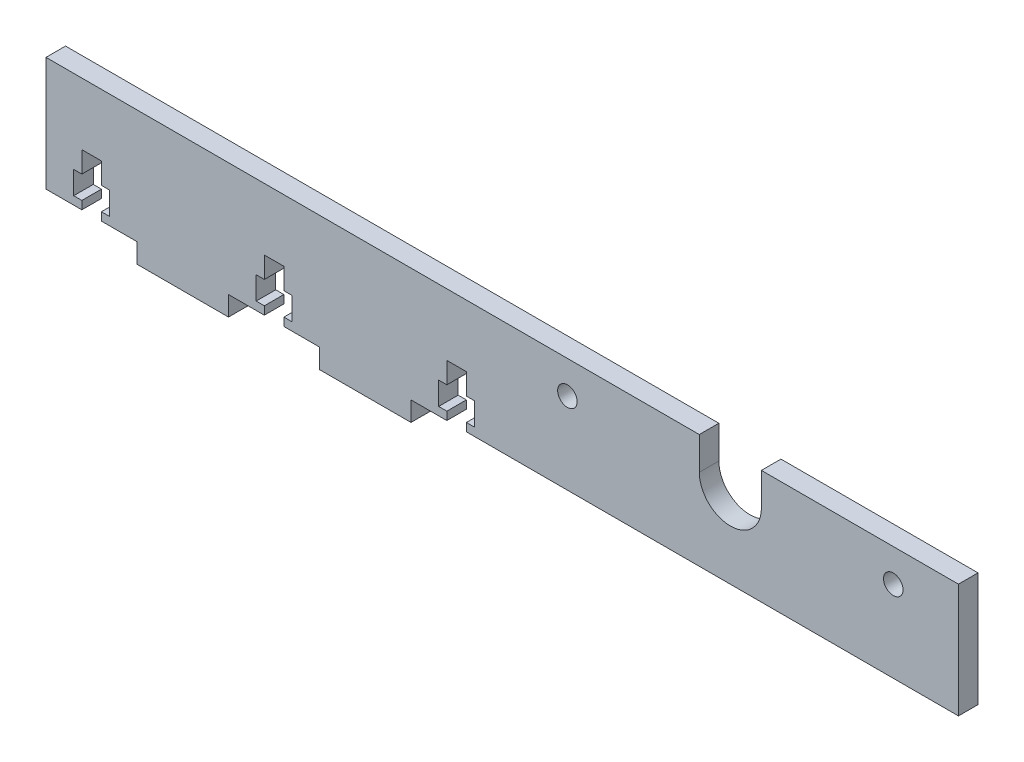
ISO-10303-21;
HEADER;
FILE_DESCRIPTION(('STEP AP214'),'2;1');
FILE_NAME('part.step','',(''),(''),'','','');
FILE_SCHEMA(('AUTOMOTIVE_DESIGN { 1 0 10303 214 1 1 1 1 }'));
ENDSEC;
DATA;
#1=APPLICATION_CONTEXT('core data for automotive mechanical design processes');
#2=APPLICATION_PROTOCOL_DEFINITION('international standard','automotive_design',2000,#1);
#3=PRODUCT_CONTEXT('',#1,'mechanical');
#4=PRODUCT('Part','Part','',(#3));
#5=PRODUCT_RELATED_PRODUCT_CATEGORY('part','',(#4));
#6=PRODUCT_DEFINITION_FORMATION('','',#4);
#7=PRODUCT_DEFINITION_CONTEXT('part definition',#1,'design');
#8=PRODUCT_DEFINITION('design','',#6,#7);
#9=PRODUCT_DEFINITION_SHAPE('','',#8);
#10=(LENGTH_UNIT() NAMED_UNIT(*) SI_UNIT(.MILLI.,.METRE.));
#11=(NAMED_UNIT(*) PLANE_ANGLE_UNIT() SI_UNIT($,.RADIAN.));
#12=(NAMED_UNIT(*) SI_UNIT($,.STERADIAN.) SOLID_ANGLE_UNIT());
#13=UNCERTAINTY_MEASURE_WITH_UNIT(LENGTH_MEASURE(1.E-05),#10,'distance_accuracy_value','');
#14=(GEOMETRIC_REPRESENTATION_CONTEXT(3) GLOBAL_UNCERTAINTY_ASSIGNED_CONTEXT((#13)) GLOBAL_UNIT_ASSIGNED_CONTEXT((#10,
#11,#12)) REPRESENTATION_CONTEXT('',''));
#15=CARTESIAN_POINT('',(0.,0.,0.));
#16=DIRECTION('',(0.,0.,1.));
#17=DIRECTION('',(1.,0.,0.));
#18=AXIS2_PLACEMENT_3D('',#15,#16,#17);
#19=CARTESIAN_POINT('',(0.,0.,3.));
#20=DIRECTION('',(0.,0.,-1.));
#21=DIRECTION('',(-1.,0.,0.));
#22=AXIS2_PLACEMENT_3D('',#19,#20,#21);
#23=CYLINDRICAL_SURFACE('',#22,4.7625);
#24=CARTESIAN_POINT('',(0.,0.,3.));
#25=DIRECTION('',(0.,0.,1.));
#26=DIRECTION('',(1.,0.,0.));
#27=AXIS2_PLACEMENT_3D('',#24,#25,#26);
#28=CIRCLE('',#27,4.7625);
#29=CARTESIAN_POINT('',(-4.7625,0.,3.));
#30=VERTEX_POINT('',#29);
#31=CARTESIAN_POINT('',(4.7625,0.,3.));
#32=VERTEX_POINT('',#31);
#33=EDGE_CURVE('E839',#30,#32,#28,.T.);
#34=ORIENTED_EDGE('',*,*,#33,.T.);
#35=DIRECTION('',(0.,0.,-1.));
#36=VECTOR('',#35,1.);
#37=CARTESIAN_POINT('',(4.7625,0.,3.));
#38=LINE('',#37,#36);
#39=CARTESIAN_POINT('',(4.7625,0.,0.));
#40=VERTEX_POINT('',#39);
#41=EDGE_CURVE('E13',#32,#40,#38,.T.);
#42=ORIENTED_EDGE('',*,*,#41,.T.);
#43=CARTESIAN_POINT('',(0.,0.,0.));
#44=DIRECTION('',(0.,0.,1.));
#45=DIRECTION('',(1.,0.,0.));
#46=AXIS2_PLACEMENT_3D('',#43,#44,#45);
#47=CIRCLE('',#46,4.7625);
#48=CARTESIAN_POINT('',(-4.7625,0.,0.));
#49=VERTEX_POINT('',#48);
#50=EDGE_CURVE('E832',#49,#40,#47,.T.);
#51=ORIENTED_EDGE('',*,*,#50,.F.);
#52=DIRECTION('',(0.,0.,-1.));
#53=VECTOR('',#52,1.);
#54=CARTESIAN_POINT('',(-4.7625,0.,3.));
#55=LINE('',#54,#53);
#56=EDGE_CURVE('E53',#30,#49,#55,.T.);
#57=ORIENTED_EDGE('',*,*,#56,.F.);
#58=EDGE_LOOP('',(#34,#42,#51,#57));
#59=FACE_BOUND('',#58,.T.);
#60=ADVANCED_FACE('F45',(#59),#23,.F.);
#61=CARTESIAN_POINT('',(0.,0.,3.));
#62=DIRECTION('',(0.,0.,1.));
#63=DIRECTION('',(1.,0.,0.));
#64=AXIS2_PLACEMENT_3D('',#61,#62,#63);
#65=PLANE('',#64);
#66=DIRECTION('',(1.,0.,0.));
#67=VECTOR('',#66,1.);
#68=CARTESIAN_POINT('',(0.,5.01350137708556,3.));
#69=LINE('',#68,#67);
#70=CARTESIAN_POINT('',(4.7625,5.01350137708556,3.));
#71=VERTEX_POINT('',#70);
#72=CARTESIAN_POINT('',(35.,5.01350137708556,3.));
#73=VERTEX_POINT('',#72);
#74=EDGE_CURVE('E626',#71,#73,#69,.T.);
#75=ORIENTED_EDGE('',*,*,#74,.F.);
#76=DIRECTION('',(0.,1.,0.));
#77=VECTOR('',#76,1.);
#78=CARTESIAN_POINT('',(4.7625,0.,3.));
#79=LINE('',#78,#77);
#80=EDGE_CURVE('E871',#32,#71,#79,.T.);
#81=ORIENTED_EDGE('',*,*,#80,.F.);
#82=ORIENTED_EDGE('',*,*,#33,.F.);
#83=DIRECTION('',(0.,1.,0.));
#84=VECTOR('',#83,1.);
#85=CARTESIAN_POINT('',(-4.7625,0.,3.));
#86=LINE('',#85,#84);
#87=CARTESIAN_POINT('',(-4.7625,5.01350137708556,3.));
#88=VERTEX_POINT('',#87);
#89=EDGE_CURVE('E67',#30,#88,#86,.T.);
#90=ORIENTED_EDGE('',*,*,#89,.T.);
#91=CARTESIAN_POINT('',(-105.,5.01350137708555,3.));
#92=VERTEX_POINT('',#91);
#93=EDGE_CURVE('E525',#92,#88,#69,.T.);
#94=ORIENTED_EDGE('',*,*,#93,.F.);
#95=DIRECTION('',(0.,-1.,0.));
#96=VECTOR('',#95,1.);
#97=CARTESIAN_POINT('',(-105.,0.,3.));
#98=LINE('',#97,#96);
#99=CARTESIAN_POINT('',(-105.,-12.5,3.));
#100=VERTEX_POINT('',#99);
#101=EDGE_CURVE('E639',#92,#100,#98,.T.);
#102=ORIENTED_EDGE('',*,*,#101,.T.);
#103=DIRECTION('',(-1.,0.,0.));
#104=VECTOR('',#103,1.);
#105=CARTESIAN_POINT('',(0.,-12.5,3.));
#106=LINE('',#105,#104);
#107=CARTESIAN_POINT('',(-99.5,-12.5,3.));
#108=VERTEX_POINT('',#107);
#109=EDGE_CURVE('E643',#108,#100,#106,.T.);
#110=ORIENTED_EDGE('',*,*,#109,.F.);
#111=DIRECTION('',(0.,1.,0.));
#112=VECTOR('',#111,1.);
#113=CARTESIAN_POINT('',(-99.5,0.,3.));
#114=LINE('',#113,#112);
#115=CARTESIAN_POINT('',(-99.5,-11.2500000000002,3.));
#116=VERTEX_POINT('',#115);
#117=EDGE_CURVE('E648',#108,#116,#114,.T.);
#118=ORIENTED_EDGE('',*,*,#117,.T.);
#119=DIRECTION('',(1.,0.,0.));
#120=VECTOR('',#119,1.);
#121=CARTESIAN_POINT('',(0.,-11.2500000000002,3.));
#122=LINE('',#121,#120);
#123=CARTESIAN_POINT('',(-100.75,-11.2500000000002,3.));
#124=VERTEX_POINT('',#123);
#125=EDGE_CURVE('E651',#124,#116,#122,.T.);
#126=ORIENTED_EDGE('',*,*,#125,.F.);
#127=DIRECTION('',(0.,1.,0.));
#128=VECTOR('',#127,1.);
#129=CARTESIAN_POINT('',(-100.75,0.,3.));
#130=LINE('',#129,#128);
#131=CARTESIAN_POINT('',(-100.75,-7.7500000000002,3.));
#132=VERTEX_POINT('',#131);
#133=EDGE_CURVE('E652',#124,#132,#130,.T.);
#134=ORIENTED_EDGE('',*,*,#133,.T.);
#135=DIRECTION('',(1.,0.,0.));
#136=VECTOR('',#135,1.);
#137=CARTESIAN_POINT('',(0.,-7.7500000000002,3.));
#138=LINE('',#137,#136);
#139=CARTESIAN_POINT('',(-99.5,-7.7500000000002,3.));
#140=VERTEX_POINT('',#139);
#141=EDGE_CURVE('E407',#132,#140,#138,.T.);
#142=ORIENTED_EDGE('',*,*,#141,.T.);
#143=CARTESIAN_POINT('',(-99.5,-4.5000000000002,3.));
#144=VERTEX_POINT('',#143);
#145=EDGE_CURVE('E521',#140,#144,#114,.T.);
#146=ORIENTED_EDGE('',*,*,#145,.T.);
#147=DIRECTION('',(1.,0.,0.));
#148=VECTOR('',#147,1.);
#149=CARTESIAN_POINT('',(0.,-4.5000000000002,3.));
#150=LINE('',#149,#148);
#151=CARTESIAN_POINT('',(-96.5,-4.5000000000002,3.));
#152=VERTEX_POINT('',#151);
#153=EDGE_CURVE('E517',#144,#152,#150,.T.);
#154=ORIENTED_EDGE('',*,*,#153,.T.);
#155=DIRECTION('',(0.,1.,0.));
#156=VECTOR('',#155,1.);
#157=CARTESIAN_POINT('',(-96.5,0.,3.));
#158=LINE('',#157,#156);
#159=CARTESIAN_POINT('',(-96.5,-7.7500000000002,3.));
#160=VERTEX_POINT('',#159);
#161=EDGE_CURVE('E405',#160,#152,#158,.T.);
#162=ORIENTED_EDGE('',*,*,#161,.F.);
#163=CARTESIAN_POINT('',(-95.25,-7.7500000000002,3.));
#164=VERTEX_POINT('',#163);
#165=EDGE_CURVE('E402',#160,#164,#138,.T.);
#166=ORIENTED_EDGE('',*,*,#165,.T.);
#167=DIRECTION('',(0.,1.,0.));
#168=VECTOR('',#167,1.);
#169=CARTESIAN_POINT('',(-95.25,0.,3.));
#170=LINE('',#169,#168);
#171=CARTESIAN_POINT('',(-95.25,-11.2500000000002,3.));
#172=VERTEX_POINT('',#171);
#173=EDGE_CURVE('E493',#172,#164,#170,.T.);
#174=ORIENTED_EDGE('',*,*,#173,.F.);
#175=CARTESIAN_POINT('',(-96.5,-11.2500000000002,3.));
#176=VERTEX_POINT('',#175);
#177=EDGE_CURVE('E392',#176,#172,#122,.T.);
#178=ORIENTED_EDGE('',*,*,#177,.F.);
#179=CARTESIAN_POINT('',(-96.5,-12.5,3.));
#180=VERTEX_POINT('',#179);
#181=EDGE_CURVE('E506',#180,#176,#158,.T.);
#182=ORIENTED_EDGE('',*,*,#181,.F.);
#183=CARTESIAN_POINT('',(-91.,-12.5,3.));
#184=VERTEX_POINT('',#183);
#185=EDGE_CURVE('E508',#184,#180,#106,.T.);
#186=ORIENTED_EDGE('',*,*,#185,.F.);
#187=DIRECTION('',(0.,-1.,0.));
#188=VECTOR('',#187,1.);
#189=CARTESIAN_POINT('',(-91.,0.,3.));
#190=LINE('',#189,#188);
#191=CARTESIAN_POINT('',(-91.,-15.5,3.));
#192=VERTEX_POINT('',#191);
#193=EDGE_CURVE('E716',#184,#192,#190,.T.);
#194=ORIENTED_EDGE('',*,*,#193,.T.);
#195=DIRECTION('',(1.,0.,0.));
#196=VECTOR('',#195,1.);
#197=CARTESIAN_POINT('',(0.,-15.5,3.));
#198=LINE('',#197,#196);
#199=CARTESIAN_POINT('',(-77.,-15.5,3.));
#200=VERTEX_POINT('',#199);
#201=EDGE_CURVE('E718',#192,#200,#198,.T.);
#202=ORIENTED_EDGE('',*,*,#201,.T.);
#203=DIRECTION('',(0.,-1.,0.));
#204=VECTOR('',#203,1.);
#205=CARTESIAN_POINT('',(-77.,0.,3.));
#206=LINE('',#205,#204);
#207=CARTESIAN_POINT('',(-77.,-12.5,3.));
#208=VERTEX_POINT('',#207);
#209=EDGE_CURVE('E721',#208,#200,#206,.T.);
#210=ORIENTED_EDGE('',*,*,#209,.F.);
#211=CARTESIAN_POINT('',(-71.5,-12.5,3.));
#212=VERTEX_POINT('',#211);
#213=EDGE_CURVE('E717',#212,#208,#106,.T.);
#214=ORIENTED_EDGE('',*,*,#213,.F.);
#215=DIRECTION('',(0.,1.,0.));
#216=VECTOR('',#215,1.);
#217=CARTESIAN_POINT('',(-71.5,0.,3.));
#218=LINE('',#217,#216);
#219=CARTESIAN_POINT('',(-71.5,-11.25,3.));
#220=VERTEX_POINT('',#219);
#221=EDGE_CURVE('E720',#212,#220,#218,.T.);
#222=ORIENTED_EDGE('',*,*,#221,.T.);
#223=DIRECTION('',(1.,0.,0.));
#224=VECTOR('',#223,1.);
#225=CARTESIAN_POINT('',(0.,-11.25,3.));
#226=LINE('',#225,#224);
#227=CARTESIAN_POINT('',(-72.75,-11.25,3.));
#228=VERTEX_POINT('',#227);
#229=EDGE_CURVE('E727',#228,#220,#226,.T.);
#230=ORIENTED_EDGE('',*,*,#229,.F.);
#231=DIRECTION('',(0.,1.,0.));
#232=VECTOR('',#231,1.);
#233=CARTESIAN_POINT('',(-72.75,0.,3.));
#234=LINE('',#233,#232);
#235=CARTESIAN_POINT('',(-72.75,-7.75,3.));
#236=VERTEX_POINT('',#235);
#237=EDGE_CURVE('E1491',#228,#236,#234,.T.);
#238=ORIENTED_EDGE('',*,*,#237,.T.);
#239=DIRECTION('',(1.,0.,0.));
#240=VECTOR('',#239,1.);
#241=CARTESIAN_POINT('',(0.,-7.75,3.));
#242=LINE('',#241,#240);
#243=CARTESIAN_POINT('',(-71.5,-7.75,3.));
#244=VERTEX_POINT('',#243);
#245=EDGE_CURVE('E1470',#236,#244,#242,.T.);
#246=ORIENTED_EDGE('',*,*,#245,.T.);
#247=CARTESIAN_POINT('',(-71.5,-4.5,3.));
#248=VERTEX_POINT('',#247);
#249=EDGE_CURVE('E729',#244,#248,#218,.T.);
#250=ORIENTED_EDGE('',*,*,#249,.T.);
#251=DIRECTION('',(1.,0.,0.));
#252=VECTOR('',#251,1.);
#253=CARTESIAN_POINT('',(0.,-4.5,3.));
#254=LINE('',#253,#252);
#255=CARTESIAN_POINT('',(-68.5,-4.5,3.));
#256=VERTEX_POINT('',#255);
#257=EDGE_CURVE('E1467',#248,#256,#254,.T.);
#258=ORIENTED_EDGE('',*,*,#257,.T.);
#259=DIRECTION('',(0.,1.,0.));
#260=VECTOR('',#259,1.);
#261=CARTESIAN_POINT('',(-68.5,0.,3.));
#262=LINE('',#261,#260);
#263=CARTESIAN_POINT('',(-68.5,-7.75,3.));
#264=VERTEX_POINT('',#263);
#265=EDGE_CURVE('E742',#264,#256,#262,.T.);
#266=ORIENTED_EDGE('',*,*,#265,.F.);
#267=CARTESIAN_POINT('',(-67.25,-7.75,3.));
#268=VERTEX_POINT('',#267);
#269=EDGE_CURVE('E1475',#264,#268,#242,.T.);
#270=ORIENTED_EDGE('',*,*,#269,.T.);
#271=DIRECTION('',(0.,1.,0.));
#272=VECTOR('',#271,1.);
#273=CARTESIAN_POINT('',(-67.25,0.,3.));
#274=LINE('',#273,#272);
#275=CARTESIAN_POINT('',(-67.25,-11.25,3.));
#276=VERTEX_POINT('',#275);
#277=EDGE_CURVE('E1476',#276,#268,#274,.T.);
#278=ORIENTED_EDGE('',*,*,#277,.F.);
#279=CARTESIAN_POINT('',(-68.5,-11.25,3.));
#280=VERTEX_POINT('',#279);
#281=EDGE_CURVE('E740',#280,#276,#226,.T.);
#282=ORIENTED_EDGE('',*,*,#281,.F.);
#283=CARTESIAN_POINT('',(-68.5,-12.5,3.));
#284=VERTEX_POINT('',#283);
#285=EDGE_CURVE('E733',#284,#280,#262,.T.);
#286=ORIENTED_EDGE('',*,*,#285,.F.);
#287=CARTESIAN_POINT('',(-63.,-12.5,3.));
#288=VERTEX_POINT('',#287);
#289=EDGE_CURVE('E722',#288,#284,#106,.T.);
#290=ORIENTED_EDGE('',*,*,#289,.F.);
#291=DIRECTION('',(0.,-1.,0.));
#292=VECTOR('',#291,1.);
#293=CARTESIAN_POINT('',(-63.,0.,3.));
#294=LINE('',#293,#292);
#295=CARTESIAN_POINT('',(-63.,-15.5,3.));
#296=VERTEX_POINT('',#295);
#297=EDGE_CURVE('E732',#288,#296,#294,.T.);
#298=ORIENTED_EDGE('',*,*,#297,.T.);
#299=DIRECTION('',(1.,0.,0.));
#300=VECTOR('',#299,1.);
#301=CARTESIAN_POINT('',(0.,-15.5,3.));
#302=LINE('',#301,#300);
#303=CARTESIAN_POINT('',(-49.,-15.5,3.));
#304=VERTEX_POINT('',#303);
#305=EDGE_CURVE('E738',#296,#304,#302,.T.);
#306=ORIENTED_EDGE('',*,*,#305,.T.);
#307=DIRECTION('',(0.,-1.,0.));
#308=VECTOR('',#307,1.);
#309=CARTESIAN_POINT('',(-49.,0.,3.));
#310=LINE('',#309,#308);
#311=CARTESIAN_POINT('',(-49.,-12.5,3.));
#312=VERTEX_POINT('',#311);
#313=EDGE_CURVE('E744',#312,#304,#310,.T.);
#314=ORIENTED_EDGE('',*,*,#313,.F.);
#315=CARTESIAN_POINT('',(-43.5,-12.5,3.));
#316=VERTEX_POINT('',#315);
#317=EDGE_CURVE('E719',#316,#312,#106,.T.);
#318=ORIENTED_EDGE('',*,*,#317,.F.);
#319=DIRECTION('',(0.,1.,0.));
#320=VECTOR('',#319,1.);
#321=CARTESIAN_POINT('',(-43.5,0.,3.));
#322=LINE('',#321,#320);
#323=CARTESIAN_POINT('',(-43.5,-11.25,3.));
#324=VERTEX_POINT('',#323);
#325=EDGE_CURVE('E743',#316,#324,#322,.T.);
#326=ORIENTED_EDGE('',*,*,#325,.T.);
#327=DIRECTION('',(1.,0.,0.));
#328=VECTOR('',#327,1.);
#329=CARTESIAN_POINT('',(0.,-11.25,3.));
#330=LINE('',#329,#328);
#331=CARTESIAN_POINT('',(-44.75,-11.25,3.));
#332=VERTEX_POINT('',#331);
#333=EDGE_CURVE('E749',#332,#324,#330,.T.);
#334=ORIENTED_EDGE('',*,*,#333,.F.);
#335=DIRECTION('',(0.,1.,0.));
#336=VECTOR('',#335,1.);
#337=CARTESIAN_POINT('',(-44.75,0.,3.));
#338=LINE('',#337,#336);
#339=CARTESIAN_POINT('',(-44.75,-7.75,3.));
#340=VERTEX_POINT('',#339);
#341=EDGE_CURVE('E774',#332,#340,#338,.T.);
#342=ORIENTED_EDGE('',*,*,#341,.T.);
#343=DIRECTION('',(1.,0.,0.));
#344=VECTOR('',#343,1.);
#345=CARTESIAN_POINT('',(0.,-7.75,3.));
#346=LINE('',#345,#344);
#347=CARTESIAN_POINT('',(-43.5,-7.75,3.));
#348=VERTEX_POINT('',#347);
#349=EDGE_CURVE('E797',#340,#348,#346,.T.);
#350=ORIENTED_EDGE('',*,*,#349,.T.);
#351=CARTESIAN_POINT('',(-43.5,-4.5,3.));
#352=VERTEX_POINT('',#351);
#353=EDGE_CURVE('E751',#348,#352,#322,.T.);
#354=ORIENTED_EDGE('',*,*,#353,.T.);
#355=DIRECTION('',(1.,0.,0.));
#356=VECTOR('',#355,1.);
#357=CARTESIAN_POINT('',(0.,-4.5,3.));
#358=LINE('',#357,#356);
#359=CARTESIAN_POINT('',(-40.5,-4.5,3.));
#360=VERTEX_POINT('',#359);
#361=EDGE_CURVE('E791',#352,#360,#358,.T.);
#362=ORIENTED_EDGE('',*,*,#361,.T.);
#363=DIRECTION('',(0.,1.,0.));
#364=VECTOR('',#363,1.);
#365=CARTESIAN_POINT('',(-40.5,0.,3.));
#366=LINE('',#365,#364);
#367=CARTESIAN_POINT('',(-40.5,-7.75,3.));
#368=VERTEX_POINT('',#367);
#369=EDGE_CURVE('E786',#368,#360,#366,.T.);
#370=ORIENTED_EDGE('',*,*,#369,.F.);
#371=CARTESIAN_POINT('',(-39.25,-7.75,3.));
#372=VERTEX_POINT('',#371);
#373=EDGE_CURVE('E790',#368,#372,#346,.T.);
#374=ORIENTED_EDGE('',*,*,#373,.T.);
#375=DIRECTION('',(0.,1.,0.));
#376=VECTOR('',#375,1.);
#377=CARTESIAN_POINT('',(-39.25,0.,3.));
#378=LINE('',#377,#376);
#379=CARTESIAN_POINT('',(-39.25,-11.25,3.));
#380=VERTEX_POINT('',#379);
#381=EDGE_CURVE('E645',#380,#372,#378,.T.);
#382=ORIENTED_EDGE('',*,*,#381,.F.);
#383=CARTESIAN_POINT('',(-40.5,-11.25,3.));
#384=VERTEX_POINT('',#383);
#385=EDGE_CURVE('E775',#384,#380,#330,.T.);
#386=ORIENTED_EDGE('',*,*,#385,.F.);
#387=CARTESIAN_POINT('',(-40.5,-12.5,3.));
#388=VERTEX_POINT('',#387);
#389=EDGE_CURVE('E644',#388,#384,#366,.T.);
#390=ORIENTED_EDGE('',*,*,#389,.F.);
#391=DIRECTION('',(1.,0.,0.));
#392=VECTOR('',#391,1.);
#393=CARTESIAN_POINT('',(0.,-12.5,3.));
#394=LINE('',#393,#392);
#395=CARTESIAN_POINT('',(35.,-12.5,3.));
#396=VERTEX_POINT('',#395);
#397=EDGE_CURVE('E835',#388,#396,#394,.T.);
#398=ORIENTED_EDGE('',*,*,#397,.T.);
#399=DIRECTION('',(0.,1.,0.));
#400=VECTOR('',#399,1.);
#401=CARTESIAN_POINT('',(35.,0.,3.));
#402=LINE('',#401,#400);
#403=EDGE_CURVE('E838',#396,#73,#402,.T.);
#404=ORIENTED_EDGE('',*,*,#403,.T.);
#405=EDGE_LOOP('',(#75,#81,#82,#90,#94,#102,#110,#118,#126,#134,#142,#146,#154,#162,#166,#174,
#178,#182,#186,#194,#202,#210,#214,#222,#230,#238,#246,#250,#258,#266,#270,#278,#282,#286,#290,
#298,#306,#314,#318,#326,#334,#342,#350,#354,#362,#370,#374,#382,#386,#390,#398,#404));
#406=FACE_BOUND('',#405,.T.);
#407=CARTESIAN_POINT('',(-25.,0.,3.));
#408=DIRECTION('',(0.,0.,1.));
#409=DIRECTION('',(1.,0.,0.));
#410=AXIS2_PLACEMENT_3D('',#407,#408,#409);
#411=CIRCLE('',#410,1.5);
#412=CARTESIAN_POINT('',(-23.5,0.,3.));
#413=VERTEX_POINT('',#412);
#414=EDGE_CURVE('E842',#413,#413,#411,.T.);
#415=ORIENTED_EDGE('',*,*,#414,.F.);
#416=EDGE_LOOP('',(#415));
#417=FACE_BOUND('',#416,.T.);
#418=CARTESIAN_POINT('',(25.,0.,3.));
#419=DIRECTION('',(0.,0.,1.));
#420=DIRECTION('',(1.,0.,0.));
#421=AXIS2_PLACEMENT_3D('',#418,#419,#420);
#422=CIRCLE('',#421,1.5);
#423=CARTESIAN_POINT('',(26.5,0.,3.));
#424=VERTEX_POINT('',#423);
#425=EDGE_CURVE('E853',#424,#424,#422,.T.);
#426=ORIENTED_EDGE('',*,*,#425,.F.);
#427=EDGE_LOOP('',(#426));
#428=FACE_BOUND('',#427,.T.);
#429=ADVANCED_FACE('F670',(#406,#417,#428),#65,.T.);
#430=CARTESIAN_POINT('',(0.,0.,0.));
#431=DIRECTION('',(0.,0.,1.));
#432=DIRECTION('',(1.,0.,0.));
#433=AXIS2_PLACEMENT_3D('',#430,#431,#432);
#434=PLANE('',#433);
#435=DIRECTION('',(0.,1.,0.));
#436=VECTOR('',#435,1.);
#437=CARTESIAN_POINT('',(4.7625,0.,0.));
#438=LINE('',#437,#436);
#439=CARTESIAN_POINT('',(4.7625,5.01350137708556,0.));
#440=VERTEX_POINT('',#439);
#441=EDGE_CURVE('E60',#40,#440,#438,.T.);
#442=ORIENTED_EDGE('',*,*,#441,.T.);
#443=DIRECTION('',(1.,0.,0.));
#444=VECTOR('',#443,1.);
#445=CARTESIAN_POINT('',(0.,5.01350137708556,0.));
#446=LINE('',#445,#444);
#447=CARTESIAN_POINT('',(35.,5.01350137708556,0.));
#448=VERTEX_POINT('',#447);
#449=EDGE_CURVE('E857',#440,#448,#446,.T.);
#450=ORIENTED_EDGE('',*,*,#449,.T.);
#451=DIRECTION('',(0.,1.,0.));
#452=VECTOR('',#451,1.);
#453=CARTESIAN_POINT('',(35.,0.,0.));
#454=LINE('',#453,#452);
#455=CARTESIAN_POINT('',(35.,-12.5,0.));
#456=VERTEX_POINT('',#455);
#457=EDGE_CURVE('E828',#456,#448,#454,.T.);
#458=ORIENTED_EDGE('',*,*,#457,.F.);
#459=DIRECTION('',(1.,0.,0.));
#460=VECTOR('',#459,1.);
#461=CARTESIAN_POINT('',(0.,-12.5,0.));
#462=LINE('',#461,#460);
#463=CARTESIAN_POINT('',(-40.5,-12.5,0.));
#464=VERTEX_POINT('',#463);
#465=EDGE_CURVE('E825',#464,#456,#462,.T.);
#466=ORIENTED_EDGE('',*,*,#465,.F.);
#467=DIRECTION('',(0.,1.,0.));
#468=VECTOR('',#467,1.);
#469=CARTESIAN_POINT('',(-40.5,0.,0.));
#470=LINE('',#469,#468);
#471=CARTESIAN_POINT('',(-40.5,-11.25,0.));
#472=VERTEX_POINT('',#471);
#473=EDGE_CURVE('E474',#464,#472,#470,.T.);
#474=ORIENTED_EDGE('',*,*,#473,.T.);
#475=DIRECTION('',(1.,0.,0.));
#476=VECTOR('',#475,1.);
#477=CARTESIAN_POINT('',(0.,-11.25,0.));
#478=LINE('',#477,#476);
#479=CARTESIAN_POINT('',(-39.25,-11.25,0.));
#480=VERTEX_POINT('',#479);
#481=EDGE_CURVE('E462',#472,#480,#478,.T.);
#482=ORIENTED_EDGE('',*,*,#481,.T.);
#483=DIRECTION('',(0.,1.,0.));
#484=VECTOR('',#483,1.);
#485=CARTESIAN_POINT('',(-39.25,0.,0.));
#486=LINE('',#485,#484);
#487=CARTESIAN_POINT('',(-39.25,-7.75,0.));
#488=VERTEX_POINT('',#487);
#489=EDGE_CURVE('E475',#480,#488,#486,.T.);
#490=ORIENTED_EDGE('',*,*,#489,.T.);
#491=DIRECTION('',(1.,0.,0.));
#492=VECTOR('',#491,1.);
#493=CARTESIAN_POINT('',(0.,-7.75,0.));
#494=LINE('',#493,#492);
#495=CARTESIAN_POINT('',(-40.5,-7.75,0.));
#496=VERTEX_POINT('',#495);
#497=EDGE_CURVE('E468',#496,#488,#494,.T.);
#498=ORIENTED_EDGE('',*,*,#497,.F.);
#499=CARTESIAN_POINT('',(-40.5,-4.5,0.));
#500=VERTEX_POINT('',#499);
#501=EDGE_CURVE('E472',#496,#500,#470,.T.);
#502=ORIENTED_EDGE('',*,*,#501,.T.);
#503=DIRECTION('',(1.,0.,0.));
#504=VECTOR('',#503,1.);
#505=CARTESIAN_POINT('',(0.,-4.5,0.));
#506=LINE('',#505,#504);
#507=CARTESIAN_POINT('',(-43.5,-4.5,0.));
#508=VERTEX_POINT('',#507);
#509=EDGE_CURVE('E469',#508,#500,#506,.T.);
#510=ORIENTED_EDGE('',*,*,#509,.F.);
#511=DIRECTION('',(0.,1.,0.));
#512=VECTOR('',#511,1.);
#513=CARTESIAN_POINT('',(-43.5,0.,0.));
#514=LINE('',#513,#512);
#515=CARTESIAN_POINT('',(-43.5,-7.75,0.));
#516=VERTEX_POINT('',#515);
#517=EDGE_CURVE('E459',#516,#508,#514,.T.);
#518=ORIENTED_EDGE('',*,*,#517,.F.);
#519=CARTESIAN_POINT('',(-44.75,-7.75,0.));
#520=VERTEX_POINT('',#519);
#521=EDGE_CURVE('E465',#520,#516,#494,.T.);
#522=ORIENTED_EDGE('',*,*,#521,.F.);
#523=DIRECTION('',(0.,1.,0.));
#524=VECTOR('',#523,1.);
#525=CARTESIAN_POINT('',(-44.75,0.,0.));
#526=LINE('',#525,#524);
#527=CARTESIAN_POINT('',(-44.75,-11.25,0.));
#528=VERTEX_POINT('',#527);
#529=EDGE_CURVE('E461',#528,#520,#526,.T.);
#530=ORIENTED_EDGE('',*,*,#529,.F.);
#531=CARTESIAN_POINT('',(-43.5,-11.25,0.));
#532=VERTEX_POINT('',#531);
#533=EDGE_CURVE('E458',#528,#532,#478,.T.);
#534=ORIENTED_EDGE('',*,*,#533,.T.);
#535=CARTESIAN_POINT('',(-43.5,-12.5,0.));
#536=VERTEX_POINT('',#535);
#537=EDGE_CURVE('E455',#536,#532,#514,.T.);
#538=ORIENTED_EDGE('',*,*,#537,.F.);
#539=DIRECTION('',(-1.,0.,0.));
#540=VECTOR('',#539,1.);
#541=CARTESIAN_POINT('',(0.,-12.5,0.));
#542=LINE('',#541,#540);
#543=CARTESIAN_POINT('',(-49.,-12.5,0.));
#544=VERTEX_POINT('',#543);
#545=EDGE_CURVE('E454',#536,#544,#542,.T.);
#546=ORIENTED_EDGE('',*,*,#545,.T.);
#547=DIRECTION('',(0.,-1.,0.));
#548=VECTOR('',#547,1.);
#549=CARTESIAN_POINT('',(-49.,0.,0.));
#550=LINE('',#549,#548);
#551=CARTESIAN_POINT('',(-49.,-15.5,0.));
#552=VERTEX_POINT('',#551);
#553=EDGE_CURVE('E452',#544,#552,#550,.T.);
#554=ORIENTED_EDGE('',*,*,#553,.T.);
#555=DIRECTION('',(1.,0.,0.));
#556=VECTOR('',#555,1.);
#557=CARTESIAN_POINT('',(0.,-15.5,0.));
#558=LINE('',#557,#556);
#559=CARTESIAN_POINT('',(-63.,-15.5,0.));
#560=VERTEX_POINT('',#559);
#561=EDGE_CURVE('E448',#560,#552,#558,.T.);
#562=ORIENTED_EDGE('',*,*,#561,.F.);
#563=DIRECTION('',(0.,-1.,0.));
#564=VECTOR('',#563,1.);
#565=CARTESIAN_POINT('',(-63.,0.,0.));
#566=LINE('',#565,#564);
#567=CARTESIAN_POINT('',(-63.,-12.5,0.));
#568=VERTEX_POINT('',#567);
#569=EDGE_CURVE('E445',#568,#560,#566,.T.);
#570=ORIENTED_EDGE('',*,*,#569,.F.);
#571=CARTESIAN_POINT('',(-68.5,-12.5,0.));
#572=VERTEX_POINT('',#571);
#573=EDGE_CURVE('E449',#568,#572,#542,.T.);
#574=ORIENTED_EDGE('',*,*,#573,.T.);
#575=DIRECTION('',(0.,1.,0.));
#576=VECTOR('',#575,1.);
#577=CARTESIAN_POINT('',(-68.5,0.,0.));
#578=LINE('',#577,#576);
#579=CARTESIAN_POINT('',(-68.5,-11.25,0.));
#580=VERTEX_POINT('',#579);
#581=EDGE_CURVE('E442',#572,#580,#578,.T.);
#582=ORIENTED_EDGE('',*,*,#581,.T.);
#583=DIRECTION('',(1.,0.,0.));
#584=VECTOR('',#583,1.);
#585=CARTESIAN_POINT('',(0.,-11.25,0.));
#586=LINE('',#585,#584);
#587=CARTESIAN_POINT('',(-67.25,-11.25,0.));
#588=VERTEX_POINT('',#587);
#589=EDGE_CURVE('E430',#580,#588,#586,.T.);
#590=ORIENTED_EDGE('',*,*,#589,.T.);
#591=DIRECTION('',(0.,1.,0.));
#592=VECTOR('',#591,1.);
#593=CARTESIAN_POINT('',(-67.25,0.,0.));
#594=LINE('',#593,#592);
#595=CARTESIAN_POINT('',(-67.25,-7.75,0.));
#596=VERTEX_POINT('',#595);
#597=EDGE_CURVE('E443',#588,#596,#594,.T.);
#598=ORIENTED_EDGE('',*,*,#597,.T.);
#599=DIRECTION('',(1.,0.,0.));
#600=VECTOR('',#599,1.);
#601=CARTESIAN_POINT('',(0.,-7.75,0.));
#602=LINE('',#601,#600);
#603=CARTESIAN_POINT('',(-68.5,-7.75,0.));
#604=VERTEX_POINT('',#603);
#605=EDGE_CURVE('E436',#604,#596,#602,.T.);
#606=ORIENTED_EDGE('',*,*,#605,.F.);
#607=CARTESIAN_POINT('',(-68.5,-4.5,0.));
#608=VERTEX_POINT('',#607);
#609=EDGE_CURVE('E440',#604,#608,#578,.T.);
#610=ORIENTED_EDGE('',*,*,#609,.T.);
#611=DIRECTION('',(1.,0.,0.));
#612=VECTOR('',#611,1.);
#613=CARTESIAN_POINT('',(0.,-4.5,0.));
#614=LINE('',#613,#612);
#615=CARTESIAN_POINT('',(-71.5,-4.5,0.));
#616=VERTEX_POINT('',#615);
#617=EDGE_CURVE('E437',#616,#608,#614,.T.);
#618=ORIENTED_EDGE('',*,*,#617,.F.);
#619=DIRECTION('',(0.,1.,0.));
#620=VECTOR('',#619,1.);
#621=CARTESIAN_POINT('',(-71.5,0.,0.));
#622=LINE('',#621,#620);
#623=CARTESIAN_POINT('',(-71.5,-7.75,0.));
#624=VERTEX_POINT('',#623);
#625=EDGE_CURVE('E427',#624,#616,#622,.T.);
#626=ORIENTED_EDGE('',*,*,#625,.F.);
#627=CARTESIAN_POINT('',(-72.75,-7.75,0.));
#628=VERTEX_POINT('',#627);
#629=EDGE_CURVE('E433',#628,#624,#602,.T.);
#630=ORIENTED_EDGE('',*,*,#629,.F.);
#631=DIRECTION('',(0.,1.,0.));
#632=VECTOR('',#631,1.);
#633=CARTESIAN_POINT('',(-72.75,0.,0.));
#634=LINE('',#633,#632);
#635=CARTESIAN_POINT('',(-72.75,-11.25,0.));
#636=VERTEX_POINT('',#635);
#637=EDGE_CURVE('E429',#636,#628,#634,.T.);
#638=ORIENTED_EDGE('',*,*,#637,.F.);
#639=CARTESIAN_POINT('',(-71.5,-11.25,0.));
#640=VERTEX_POINT('',#639);
#641=EDGE_CURVE('E426',#636,#640,#586,.T.);
#642=ORIENTED_EDGE('',*,*,#641,.T.);
#643=CARTESIAN_POINT('',(-71.5,-12.5,0.));
#644=VERTEX_POINT('',#643);
#645=EDGE_CURVE('E423',#644,#640,#622,.T.);
#646=ORIENTED_EDGE('',*,*,#645,.F.);
#647=CARTESIAN_POINT('',(-77.,-12.5,0.));
#648=VERTEX_POINT('',#647);
#649=EDGE_CURVE('E415',#644,#648,#542,.T.);
#650=ORIENTED_EDGE('',*,*,#649,.T.);
#651=DIRECTION('',(0.,-1.,0.));
#652=VECTOR('',#651,1.);
#653=CARTESIAN_POINT('',(-77.,0.,0.));
#654=LINE('',#653,#652);
#655=CARTESIAN_POINT('',(-77.,-15.5,0.));
#656=VERTEX_POINT('',#655);
#657=EDGE_CURVE('E421',#648,#656,#654,.T.);
#658=ORIENTED_EDGE('',*,*,#657,.T.);
#659=DIRECTION('',(1.,0.,0.));
#660=VECTOR('',#659,1.);
#661=CARTESIAN_POINT('',(0.,-15.5,0.));
#662=LINE('',#661,#660);
#663=CARTESIAN_POINT('',(-91.,-15.5,0.));
#664=VERTEX_POINT('',#663);
#665=EDGE_CURVE('E418',#664,#656,#662,.T.);
#666=ORIENTED_EDGE('',*,*,#665,.F.);
#667=DIRECTION('',(0.,-1.,0.));
#668=VECTOR('',#667,1.);
#669=CARTESIAN_POINT('',(-91.,0.,0.));
#670=LINE('',#669,#668);
#671=CARTESIAN_POINT('',(-91.,-12.5,0.));
#672=VERTEX_POINT('',#671);
#673=EDGE_CURVE('E413',#672,#664,#670,.T.);
#674=ORIENTED_EDGE('',*,*,#673,.F.);
#675=CARTESIAN_POINT('',(-96.5,-12.5,0.));
#676=VERTEX_POINT('',#675);
#677=EDGE_CURVE('E410',#672,#676,#542,.T.);
#678=ORIENTED_EDGE('',*,*,#677,.T.);
#679=DIRECTION('',(0.,1.,0.));
#680=VECTOR('',#679,1.);
#681=CARTESIAN_POINT('',(-96.5,0.,0.));
#682=LINE('',#681,#680);
#683=CARTESIAN_POINT('',(-96.5,-11.2500000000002,0.));
#684=VERTEX_POINT('',#683);
#685=EDGE_CURVE('E382',#676,#684,#682,.T.);
#686=ORIENTED_EDGE('',*,*,#685,.T.);
#687=DIRECTION('',(1.,0.,0.));
#688=VECTOR('',#687,1.);
#689=CARTESIAN_POINT('',(0.,-11.2500000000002,0.));
#690=LINE('',#689,#688);
#691=CARTESIAN_POINT('',(-95.25,-11.2500000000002,0.));
#692=VERTEX_POINT('',#691);
#693=EDGE_CURVE('E373',#684,#692,#690,.T.);
#694=ORIENTED_EDGE('',*,*,#693,.T.);
#695=DIRECTION('',(0.,1.,0.));
#696=VECTOR('',#695,1.);
#697=CARTESIAN_POINT('',(-95.25,0.,0.));
#698=LINE('',#697,#696);
#699=CARTESIAN_POINT('',(-95.25,-7.7500000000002,0.));
#700=VERTEX_POINT('',#699);
#701=EDGE_CURVE('E379',#692,#700,#698,.T.);
#702=ORIENTED_EDGE('',*,*,#701,.T.);
#703=DIRECTION('',(1.,0.,0.));
#704=VECTOR('',#703,1.);
#705=CARTESIAN_POINT('',(0.,-7.7500000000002,0.));
#706=LINE('',#705,#704);
#707=CARTESIAN_POINT('',(-96.5,-7.7500000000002,0.));
#708=VERTEX_POINT('',#707);
#709=EDGE_CURVE('E397',#708,#700,#706,.T.);
#710=ORIENTED_EDGE('',*,*,#709,.F.);
#711=CARTESIAN_POINT('',(-96.5,-4.5000000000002,0.));
#712=VERTEX_POINT('',#711);
#713=EDGE_CURVE('E411',#708,#712,#682,.T.);
#714=ORIENTED_EDGE('',*,*,#713,.T.);
#715=DIRECTION('',(1.,0.,0.));
#716=VECTOR('',#715,1.);
#717=CARTESIAN_POINT('',(0.,-4.5000000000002,0.));
#718=LINE('',#717,#716);
#719=CARTESIAN_POINT('',(-99.5,-4.5000000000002,0.));
#720=VERTEX_POINT('',#719);
#721=EDGE_CURVE('E490',#720,#712,#718,.T.);
#722=ORIENTED_EDGE('',*,*,#721,.F.);
#723=DIRECTION('',(0.,1.,0.));
#724=VECTOR('',#723,1.);
#725=CARTESIAN_POINT('',(-99.5,0.,0.));
#726=LINE('',#725,#724);
#727=CARTESIAN_POINT('',(-99.5,-7.7500000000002,0.));
#728=VERTEX_POINT('',#727);
#729=EDGE_CURVE('E483',#728,#720,#726,.T.);
#730=ORIENTED_EDGE('',*,*,#729,.F.);
#731=CARTESIAN_POINT('',(-100.75,-7.7500000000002,0.));
#732=VERTEX_POINT('',#731);
#733=EDGE_CURVE('E487',#732,#728,#706,.T.);
#734=ORIENTED_EDGE('',*,*,#733,.F.);
#735=DIRECTION('',(0.,1.,0.));
#736=VECTOR('',#735,1.);
#737=CARTESIAN_POINT('',(-100.75,0.,0.));
#738=LINE('',#737,#736);
#739=CARTESIAN_POINT('',(-100.75,-11.2500000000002,0.));
#740=VERTEX_POINT('',#739);
#741=EDGE_CURVE('E484',#740,#732,#738,.T.);
#742=ORIENTED_EDGE('',*,*,#741,.F.);
#743=CARTESIAN_POINT('',(-99.5,-11.2500000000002,0.));
#744=VERTEX_POINT('',#743);
#745=EDGE_CURVE('E387',#740,#744,#690,.T.);
#746=ORIENTED_EDGE('',*,*,#745,.T.);
#747=CARTESIAN_POINT('',(-99.5,-12.5,0.));
#748=VERTEX_POINT('',#747);
#749=EDGE_CURVE('E480',#748,#744,#726,.T.);
#750=ORIENTED_EDGE('',*,*,#749,.F.);
#751=CARTESIAN_POINT('',(-105.,-12.5,0.));
#752=VERTEX_POINT('',#751);
#753=EDGE_CURVE('E414',#748,#752,#542,.T.);
#754=ORIENTED_EDGE('',*,*,#753,.T.);
#755=DIRECTION('',(0.,-1.,0.));
#756=VECTOR('',#755,1.);
#757=CARTESIAN_POINT('',(-105.,0.,0.));
#758=LINE('',#757,#756);
#759=CARTESIAN_POINT('',(-105.,5.01350137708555,0.));
#760=VERTEX_POINT('',#759);
#761=EDGE_CURVE('E477',#760,#752,#758,.T.);
#762=ORIENTED_EDGE('',*,*,#761,.F.);
#763=DIRECTION('',(1.,0.,0.));
#764=VECTOR('',#763,1.);
#765=CARTESIAN_POINT('',(0.,5.01350137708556,0.));
#766=LINE('',#765,#764);
#767=CARTESIAN_POINT('',(-4.7625,5.01350137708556,0.));
#768=VERTEX_POINT('',#767);
#769=EDGE_CURVE('E859',#760,#768,#766,.T.);
#770=ORIENTED_EDGE('',*,*,#769,.T.);
#771=DIRECTION('',(0.,1.,0.));
#772=VECTOR('',#771,1.);
#773=CARTESIAN_POINT('',(-4.7625,0.,0.));
#774=LINE('',#773,#772);
#775=EDGE_CURVE('E863',#49,#768,#774,.T.);
#776=ORIENTED_EDGE('',*,*,#775,.F.);
#777=ORIENTED_EDGE('',*,*,#50,.T.);
#778=EDGE_LOOP('',(#442,#450,#458,#466,#474,#482,#490,#498,#502,#510,#518,#522,#530,#534,#538,
#546,#554,#562,#570,#574,#582,#590,#598,#606,#610,#618,#626,#630,#638,#642,#646,#650,#658,#666,
#674,#678,#686,#694,#702,#710,#714,#722,#730,#734,#742,#746,#750,#754,#762,#770,#776,#777));
#779=FACE_BOUND('',#778,.T.);
#780=CARTESIAN_POINT('',(-25.,0.,0.));
#781=DIRECTION('',(0.,0.,1.));
#782=DIRECTION('',(1.,0.,0.));
#783=AXIS2_PLACEMENT_3D('',#780,#781,#782);
#784=CIRCLE('',#783,1.5);
#785=CARTESIAN_POINT('',(-23.5,0.,0.));
#786=VERTEX_POINT('',#785);
#787=EDGE_CURVE('E883',#786,#786,#784,.T.);
#788=ORIENTED_EDGE('',*,*,#787,.T.);
#789=EDGE_LOOP('',(#788));
#790=FACE_BOUND('',#789,.T.);
#791=CARTESIAN_POINT('',(25.,0.,0.));
#792=DIRECTION('',(0.,0.,1.));
#793=DIRECTION('',(1.,0.,0.));
#794=AXIS2_PLACEMENT_3D('',#791,#792,#793);
#795=CIRCLE('',#794,1.5);
#796=CARTESIAN_POINT('',(26.5,0.,0.));
#797=VERTEX_POINT('',#796);
#798=EDGE_CURVE('E849',#797,#797,#795,.T.);
#799=ORIENTED_EDGE('',*,*,#798,.T.);
#800=EDGE_LOOP('',(#799));
#801=FACE_BOUND('',#800,.T.);
#802=ADVANCED_FACE('F375',(#779,#790,#801),#434,.F.);
#803=CARTESIAN_POINT('',(0.,-12.5,3.));
#804=DIRECTION('',(0.,1.,0.));
#805=DIRECTION('',(0.,0.,1.));
#806=AXIS2_PLACEMENT_3D('',#803,#804,#805);
#807=PLANE('',#806);
#808=ORIENTED_EDGE('',*,*,#465,.T.);
#809=DIRECTION('',(0.,0.,-1.));
#810=VECTOR('',#809,1.);
#811=CARTESIAN_POINT('',(35.,-12.5,3.));
#812=LINE('',#811,#810);
#813=EDGE_CURVE('E836',#396,#456,#812,.T.);
#814=ORIENTED_EDGE('',*,*,#813,.F.);
#815=ORIENTED_EDGE('',*,*,#397,.F.);
#816=DIRECTION('',(0.,0.,1.));
#817=VECTOR('',#816,1.);
#818=CARTESIAN_POINT('',(-40.5,-12.5,0.));
#819=LINE('',#818,#817);
#820=EDGE_CURVE('E547',#464,#388,#819,.T.);
#821=ORIENTED_EDGE('',*,*,#820,.F.);
#822=EDGE_LOOP('',(#808,#814,#815,#821));
#823=FACE_BOUND('',#822,.T.);
#824=ADVANCED_FACE('F834',(#823),#807,.F.);
#825=CARTESIAN_POINT('',(35.,0.,3.));
#826=DIRECTION('',(-1.,0.,0.));
#827=DIRECTION('',(0.,0.,1.));
#828=AXIS2_PLACEMENT_3D('',#825,#826,#827);
#829=PLANE('',#828);
#830=ORIENTED_EDGE('',*,*,#457,.T.);
#831=DIRECTION('',(0.,0.,1.));
#832=VECTOR('',#831,1.);
#833=CARTESIAN_POINT('',(35.,5.01350137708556,-7.));
#834=LINE('',#833,#832);
#835=EDGE_CURVE('E865',#448,#73,#834,.T.);
#836=ORIENTED_EDGE('',*,*,#835,.T.);
#837=ORIENTED_EDGE('',*,*,#403,.F.);
#838=ORIENTED_EDGE('',*,*,#813,.T.);
#839=EDGE_LOOP('',(#830,#836,#837,#838));
#840=FACE_BOUND('',#839,.T.);
#841=ADVANCED_FACE('F900',(#840),#829,.F.);
#842=CARTESIAN_POINT('',(-25.,0.,3.));
#843=DIRECTION('',(0.,0.,-1.));
#844=DIRECTION('',(-1.,0.,0.));
#845=AXIS2_PLACEMENT_3D('',#842,#843,#844);
#846=CYLINDRICAL_SURFACE('',#845,1.5);
#847=ORIENTED_EDGE('',*,*,#414,.T.);
#848=EDGE_LOOP('',(#847));
#849=FACE_BOUND('',#848,.T.);
#850=ORIENTED_EDGE('',*,*,#787,.F.);
#851=EDGE_LOOP('',(#850));
#852=FACE_BOUND('',#851,.T.);
#853=ADVANCED_FACE('F892',(#849,#852),#846,.F.);
#854=CARTESIAN_POINT('',(25.,0.,3.));
#855=DIRECTION('',(0.,0.,-1.));
#856=DIRECTION('',(-1.,0.,0.));
#857=AXIS2_PLACEMENT_3D('',#854,#855,#856);
#858=CYLINDRICAL_SURFACE('',#857,1.5);
#859=ORIENTED_EDGE('',*,*,#425,.T.);
#860=EDGE_LOOP('',(#859));
#861=FACE_BOUND('',#860,.T.);
#862=ORIENTED_EDGE('',*,*,#798,.F.);
#863=EDGE_LOOP('',(#862));
#864=FACE_BOUND('',#863,.T.);
#865=ADVANCED_FACE('F47',(#861,#864),#858,.F.);
#866=CARTESIAN_POINT('',(-4.7625,0.,-7.));
#867=DIRECTION('',(1.,0.,0.));
#868=DIRECTION('',(0.,0.,-1.));
#869=AXIS2_PLACEMENT_3D('',#866,#867,#868);
#870=PLANE('',#869);
#871=ORIENTED_EDGE('',*,*,#775,.T.);
#872=DIRECTION('',(0.,0.,1.));
#873=VECTOR('',#872,1.);
#874=CARTESIAN_POINT('',(-4.7625,5.01350137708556,-7.));
#875=LINE('',#874,#873);
#876=EDGE_CURVE('E866',#768,#88,#875,.T.);
#877=ORIENTED_EDGE('',*,*,#876,.T.);
#878=ORIENTED_EDGE('',*,*,#89,.F.);
#879=ORIENTED_EDGE('',*,*,#56,.T.);
#880=EDGE_LOOP('',(#871,#877,#878,#879));
#881=FACE_BOUND('',#880,.T.);
#882=ADVANCED_FACE('F891',(#881),#870,.T.);
#883=CARTESIAN_POINT('',(0.,5.01350137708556,-7.));
#884=DIRECTION('',(0.,-1.,0.));
#885=DIRECTION('',(0.,0.,-1.));
#886=AXIS2_PLACEMENT_3D('',#883,#884,#885);
#887=PLANE('',#886);
#888=ORIENTED_EDGE('',*,*,#769,.F.);
#889=DIRECTION('',(0.,0.,1.));
#890=VECTOR('',#889,1.);
#891=CARTESIAN_POINT('',(-105.,5.01350137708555,0.));
#892=LINE('',#891,#890);
#893=EDGE_CURVE('E544',#760,#92,#892,.T.);
#894=ORIENTED_EDGE('',*,*,#893,.T.);
#895=ORIENTED_EDGE('',*,*,#93,.T.);
#896=ORIENTED_EDGE('',*,*,#876,.F.);
#897=EDGE_LOOP('',(#888,#894,#895,#896));
#898=FACE_BOUND('',#897,.T.);
#899=ADVANCED_FACE('F898',(#898),#887,.F.);
#900=DIRECTION('',(0.,0.,1.));
#901=VECTOR('',#900,1.);
#902=CARTESIAN_POINT('',(4.7625,5.01350137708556,-7.));
#903=LINE('',#902,#901);
#904=EDGE_CURVE('E868',#440,#71,#903,.T.);
#905=ORIENTED_EDGE('',*,*,#904,.T.);
#906=ORIENTED_EDGE('',*,*,#74,.T.);
#907=ORIENTED_EDGE('',*,*,#835,.F.);
#908=ORIENTED_EDGE('',*,*,#449,.F.);
#909=EDGE_LOOP('',(#905,#906,#907,#908));
#910=FACE_BOUND('',#909,.T.);
#911=ADVANCED_FACE('F919',(#910),#887,.F.);
#912=CARTESIAN_POINT('',(4.7625,0.,-7.));
#913=DIRECTION('',(1.,0.,0.));
#914=DIRECTION('',(0.,0.,-1.));
#915=AXIS2_PLACEMENT_3D('',#912,#913,#914);
#916=PLANE('',#915);
#917=ORIENTED_EDGE('',*,*,#41,.F.);
#918=ORIENTED_EDGE('',*,*,#80,.T.);
#919=ORIENTED_EDGE('',*,*,#904,.F.);
#920=ORIENTED_EDGE('',*,*,#441,.F.);
#921=EDGE_LOOP('',(#917,#918,#919,#920));
#922=FACE_BOUND('',#921,.T.);
#923=ADVANCED_FACE('F916',(#922),#916,.F.);
#924=CARTESIAN_POINT('',(-95.25,0.,0.));
#925=DIRECTION('',(1.,0.,0.));
#926=DIRECTION('',(0.,0.,-1.));
#927=AXIS2_PLACEMENT_3D('',#924,#925,#926);
#928=PLANE('',#927);
#929=ORIENTED_EDGE('',*,*,#173,.T.);
#930=DIRECTION('',(0.,0.,1.));
#931=VECTOR('',#930,1.);
#932=CARTESIAN_POINT('',(-95.25,-7.7500000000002,0.));
#933=LINE('',#932,#931);
#934=EDGE_CURVE('E400',#700,#164,#933,.T.);
#935=ORIENTED_EDGE('',*,*,#934,.F.);
#936=ORIENTED_EDGE('',*,*,#701,.F.);
#937=DIRECTION('',(0.,0.,1.));
#938=VECTOR('',#937,1.);
#939=CARTESIAN_POINT('',(-95.25,-11.2500000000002,0.));
#940=LINE('',#939,#938);
#941=EDGE_CURVE('E389',#692,#172,#940,.T.);
#942=ORIENTED_EDGE('',*,*,#941,.T.);
#943=EDGE_LOOP('',(#929,#935,#936,#942));
#944=FACE_BOUND('',#943,.T.);
#945=ADVANCED_FACE('F399',(#944),#928,.F.);
#946=CARTESIAN_POINT('',(0.,-7.7500000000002,0.));
#947=DIRECTION('',(0.,-1.,0.));
#948=DIRECTION('',(0.,0.,-1.));
#949=AXIS2_PLACEMENT_3D('',#946,#947,#948);
#950=PLANE('',#949);
#951=ORIENTED_EDGE('',*,*,#165,.F.);
#952=DIRECTION('',(0.,0.,1.));
#953=VECTOR('',#952,1.);
#954=CARTESIAN_POINT('',(-96.5,-7.7500000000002,0.));
#955=LINE('',#954,#953);
#956=EDGE_CURVE('E526',#708,#160,#955,.T.);
#957=ORIENTED_EDGE('',*,*,#956,.F.);
#958=ORIENTED_EDGE('',*,*,#709,.T.);
#959=ORIENTED_EDGE('',*,*,#934,.T.);
#960=EDGE_LOOP('',(#951,#957,#958,#959));
#961=FACE_BOUND('',#960,.T.);
#962=ADVANCED_FACE('F704',(#961),#950,.T.);
#963=CARTESIAN_POINT('',(-96.5,0.,0.));
#964=DIRECTION('',(1.,0.,0.));
#965=DIRECTION('',(0.,0.,-1.));
#966=AXIS2_PLACEMENT_3D('',#963,#964,#965);
#967=PLANE('',#966);
#968=ORIENTED_EDGE('',*,*,#161,.T.);
#969=DIRECTION('',(0.,0.,1.));
#970=VECTOR('',#969,1.);
#971=CARTESIAN_POINT('',(-96.5,-4.5000000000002,0.));
#972=LINE('',#971,#970);
#973=EDGE_CURVE('E528',#712,#152,#972,.T.);
#974=ORIENTED_EDGE('',*,*,#973,.F.);
#975=ORIENTED_EDGE('',*,*,#713,.F.);
#976=ORIENTED_EDGE('',*,*,#956,.T.);
#977=EDGE_LOOP('',(#968,#974,#975,#976));
#978=FACE_BOUND('',#977,.T.);
#979=ADVANCED_FACE('F701',(#978),#967,.F.);
#980=CARTESIAN_POINT('',(0.,-4.5000000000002,0.));
#981=DIRECTION('',(0.,-1.,0.));
#982=DIRECTION('',(0.,0.,-1.));
#983=AXIS2_PLACEMENT_3D('',#980,#981,#982);
#984=PLANE('',#983);
#985=ORIENTED_EDGE('',*,*,#153,.F.);
#986=DIRECTION('',(0.,0.,1.));
#987=VECTOR('',#986,1.);
#988=CARTESIAN_POINT('',(-99.5,-4.5000000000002,0.));
#989=LINE('',#988,#987);
#990=EDGE_CURVE('E530',#720,#144,#989,.T.);
#991=ORIENTED_EDGE('',*,*,#990,.F.);
#992=ORIENTED_EDGE('',*,*,#721,.T.);
#993=ORIENTED_EDGE('',*,*,#973,.T.);
#994=EDGE_LOOP('',(#985,#991,#992,#993));
#995=FACE_BOUND('',#994,.T.);
#996=ADVANCED_FACE('F696',(#995),#984,.T.);
#997=CARTESIAN_POINT('',(-99.5,0.,0.));
#998=DIRECTION('',(1.,0.,0.));
#999=DIRECTION('',(0.,0.,-1.));
#1000=AXIS2_PLACEMENT_3D('',#997,#998,#999);
#1001=PLANE('',#1000);
#1002=ORIENTED_EDGE('',*,*,#145,.F.);
#1003=DIRECTION('',(0.,0.,1.));
#1004=VECTOR('',#1003,1.);
#1005=CARTESIAN_POINT('',(-99.5,-7.7500000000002,0.));
#1006=LINE('',#1005,#1004);
#1007=EDGE_CURVE('E532',#728,#140,#1006,.T.);
#1008=ORIENTED_EDGE('',*,*,#1007,.F.);
#1009=ORIENTED_EDGE('',*,*,#729,.T.);
#1010=ORIENTED_EDGE('',*,*,#990,.T.);
#1011=EDGE_LOOP('',(#1002,#1008,#1009,#1010));
#1012=FACE_BOUND('',#1011,.T.);
#1013=ADVANCED_FACE('F692',(#1012),#1001,.T.);
#1014=ORIENTED_EDGE('',*,*,#141,.F.);
#1015=DIRECTION('',(0.,0.,1.));
#1016=VECTOR('',#1015,1.);
#1017=CARTESIAN_POINT('',(-100.75,-7.7500000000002,0.));
#1018=LINE('',#1017,#1016);
#1019=EDGE_CURVE('E534',#732,#132,#1018,.T.);
#1020=ORIENTED_EDGE('',*,*,#1019,.F.);
#1021=ORIENTED_EDGE('',*,*,#733,.T.);
#1022=ORIENTED_EDGE('',*,*,#1007,.T.);
#1023=EDGE_LOOP('',(#1014,#1020,#1021,#1022));
#1024=FACE_BOUND('',#1023,.T.);
#1025=ADVANCED_FACE('F686',(#1024),#950,.T.);
#1026=CARTESIAN_POINT('',(-100.75,0.,0.));
#1027=DIRECTION('',(1.,0.,0.));
#1028=DIRECTION('',(0.,0.,-1.));
#1029=AXIS2_PLACEMENT_3D('',#1026,#1027,#1028);
#1030=PLANE('',#1029);
#1031=ORIENTED_EDGE('',*,*,#133,.F.);
#1032=DIRECTION('',(0.,0.,1.));
#1033=VECTOR('',#1032,1.);
#1034=CARTESIAN_POINT('',(-100.75,-11.2500000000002,0.));
#1035=LINE('',#1034,#1033);
#1036=EDGE_CURVE('E536',#740,#124,#1035,.T.);
#1037=ORIENTED_EDGE('',*,*,#1036,.F.);
#1038=ORIENTED_EDGE('',*,*,#741,.T.);
#1039=ORIENTED_EDGE('',*,*,#1019,.T.);
#1040=EDGE_LOOP('',(#1031,#1037,#1038,#1039));
#1041=FACE_BOUND('',#1040,.T.);
#1042=ADVANCED_FACE('F683',(#1041),#1030,.T.);
#1043=CARTESIAN_POINT('',(0.,-11.2500000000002,0.));
#1044=DIRECTION('',(0.,-1.,0.));
#1045=DIRECTION('',(0.,0.,-1.));
#1046=AXIS2_PLACEMENT_3D('',#1043,#1044,#1045);
#1047=PLANE('',#1046);
#1048=ORIENTED_EDGE('',*,*,#125,.T.);
#1049=DIRECTION('',(0.,0.,1.));
#1050=VECTOR('',#1049,1.);
#1051=CARTESIAN_POINT('',(-99.5,-11.2500000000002,0.));
#1052=LINE('',#1051,#1050);
#1053=EDGE_CURVE('E538',#744,#116,#1052,.T.);
#1054=ORIENTED_EDGE('',*,*,#1053,.F.);
#1055=ORIENTED_EDGE('',*,*,#745,.F.);
#1056=ORIENTED_EDGE('',*,*,#1036,.T.);
#1057=EDGE_LOOP('',(#1048,#1054,#1055,#1056));
#1058=FACE_BOUND('',#1057,.T.);
#1059=ADVANCED_FACE('F665',(#1058),#1047,.F.);
#1060=ORIENTED_EDGE('',*,*,#117,.F.);
#1061=DIRECTION('',(0.,0.,1.));
#1062=VECTOR('',#1061,1.);
#1063=CARTESIAN_POINT('',(-99.5,-12.5,0.));
#1064=LINE('',#1063,#1062);
#1065=EDGE_CURVE('E540',#748,#108,#1064,.T.);
#1066=ORIENTED_EDGE('',*,*,#1065,.F.);
#1067=ORIENTED_EDGE('',*,*,#749,.T.);
#1068=ORIENTED_EDGE('',*,*,#1053,.T.);
#1069=EDGE_LOOP('',(#1060,#1066,#1067,#1068));
#1070=FACE_BOUND('',#1069,.T.);
#1071=ADVANCED_FACE('F674',(#1070),#1001,.T.);
#1072=CARTESIAN_POINT('',(0.,-12.5,0.));
#1073=DIRECTION('',(0.,1.,0.));
#1074=DIRECTION('',(-1.,0.,0.));
#1075=AXIS2_PLACEMENT_3D('',#1072,#1073,#1074);
#1076=PLANE('',#1075);
#1077=ORIENTED_EDGE('',*,*,#109,.T.);
#1078=DIRECTION('',(0.,0.,1.));
#1079=VECTOR('',#1078,1.);
#1080=CARTESIAN_POINT('',(-105.,-12.5,0.));
#1081=LINE('',#1080,#1079);
#1082=EDGE_CURVE('E542',#752,#100,#1081,.T.);
#1083=ORIENTED_EDGE('',*,*,#1082,.F.);
#1084=ORIENTED_EDGE('',*,*,#753,.F.);
#1085=ORIENTED_EDGE('',*,*,#1065,.T.);
#1086=EDGE_LOOP('',(#1077,#1083,#1084,#1085));
#1087=FACE_BOUND('',#1086,.T.);
#1088=ADVANCED_FACE('F1013',(#1087),#1076,.F.);
#1089=CARTESIAN_POINT('',(-105.,0.,0.));
#1090=DIRECTION('',(-1.,0.,0.));
#1091=DIRECTION('',(0.,0.,1.));
#1092=AXIS2_PLACEMENT_3D('',#1089,#1090,#1091);
#1093=PLANE('',#1092);
#1094=ORIENTED_EDGE('',*,*,#101,.F.);
#1095=ORIENTED_EDGE('',*,*,#893,.F.);
#1096=ORIENTED_EDGE('',*,*,#761,.T.);
#1097=ORIENTED_EDGE('',*,*,#1082,.T.);
#1098=EDGE_LOOP('',(#1094,#1095,#1096,#1097));
#1099=FACE_BOUND('',#1098,.T.);
#1100=ADVANCED_FACE('F1010',(#1099),#1093,.T.);
#1101=CARTESIAN_POINT('',(-40.5,0.,0.));
#1102=DIRECTION('',(1.,0.,0.));
#1103=DIRECTION('',(0.,0.,-1.));
#1104=AXIS2_PLACEMENT_3D('',#1101,#1102,#1103);
#1105=PLANE('',#1104);
#1106=ORIENTED_EDGE('',*,*,#389,.T.);
#1107=DIRECTION('',(0.,0.,1.));
#1108=VECTOR('',#1107,1.);
#1109=CARTESIAN_POINT('',(-40.5,-11.25,0.));
#1110=LINE('',#1109,#1108);
#1111=EDGE_CURVE('E550',#472,#384,#1110,.T.);
#1112=ORIENTED_EDGE('',*,*,#1111,.F.);
#1113=ORIENTED_EDGE('',*,*,#473,.F.);
#1114=ORIENTED_EDGE('',*,*,#820,.T.);
#1115=EDGE_LOOP('',(#1106,#1112,#1113,#1114));
#1116=FACE_BOUND('',#1115,.T.);
#1117=ADVANCED_FACE('F817',(#1116),#1105,.F.);
#1118=CARTESIAN_POINT('',(0.,-11.25,0.));
#1119=DIRECTION('',(0.,-1.,0.));
#1120=DIRECTION('',(0.,0.,-1.));
#1121=AXIS2_PLACEMENT_3D('',#1118,#1119,#1120);
#1122=PLANE('',#1121);
#1123=ORIENTED_EDGE('',*,*,#385,.T.);
#1124=DIRECTION('',(0.,0.,1.));
#1125=VECTOR('',#1124,1.);
#1126=CARTESIAN_POINT('',(-39.25,-11.25,0.));
#1127=LINE('',#1126,#1125);
#1128=EDGE_CURVE('E553',#480,#380,#1127,.T.);
#1129=ORIENTED_EDGE('',*,*,#1128,.F.);
#1130=ORIENTED_EDGE('',*,*,#481,.F.);
#1131=ORIENTED_EDGE('',*,*,#1111,.T.);
#1132=EDGE_LOOP('',(#1123,#1129,#1130,#1131));
#1133=FACE_BOUND('',#1132,.T.);
#1134=ADVANCED_FACE('F822',(#1133),#1122,.F.);
#1135=CARTESIAN_POINT('',(-39.25,0.,0.));
#1136=DIRECTION('',(1.,0.,0.));
#1137=DIRECTION('',(0.,0.,-1.));
#1138=AXIS2_PLACEMENT_3D('',#1135,#1136,#1137);
#1139=PLANE('',#1138);
#1140=ORIENTED_EDGE('',*,*,#381,.T.);
#1141=DIRECTION('',(0.,0.,1.));
#1142=VECTOR('',#1141,1.);
#1143=CARTESIAN_POINT('',(-39.25,-7.75,0.));
#1144=LINE('',#1143,#1142);
#1145=EDGE_CURVE('E556',#488,#372,#1144,.T.);
#1146=ORIENTED_EDGE('',*,*,#1145,.F.);
#1147=ORIENTED_EDGE('',*,*,#489,.F.);
#1148=ORIENTED_EDGE('',*,*,#1128,.T.);
#1149=EDGE_LOOP('',(#1140,#1146,#1147,#1148));
#1150=FACE_BOUND('',#1149,.T.);
#1151=ADVANCED_FACE('F1002',(#1150),#1139,.F.);
#1152=CARTESIAN_POINT('',(0.,-7.75,0.));
#1153=DIRECTION('',(0.,-1.,0.));
#1154=DIRECTION('',(0.,0.,-1.));
#1155=AXIS2_PLACEMENT_3D('',#1152,#1153,#1154);
#1156=PLANE('',#1155);
#1157=ORIENTED_EDGE('',*,*,#373,.F.);
#1158=DIRECTION('',(0.,0.,1.));
#1159=VECTOR('',#1158,1.);
#1160=CARTESIAN_POINT('',(-40.5,-7.75,0.));
#1161=LINE('',#1160,#1159);
#1162=EDGE_CURVE('E558',#496,#368,#1161,.T.);
#1163=ORIENTED_EDGE('',*,*,#1162,.F.);
#1164=ORIENTED_EDGE('',*,*,#497,.T.);
#1165=ORIENTED_EDGE('',*,*,#1145,.T.);
#1166=EDGE_LOOP('',(#1157,#1163,#1164,#1165));
#1167=FACE_BOUND('',#1166,.T.);
#1168=ADVANCED_FACE('F999',(#1167),#1156,.T.);
#1169=ORIENTED_EDGE('',*,*,#369,.T.);
#1170=DIRECTION('',(0.,0.,1.));
#1171=VECTOR('',#1170,1.);
#1172=CARTESIAN_POINT('',(-40.5,-4.5,0.));
#1173=LINE('',#1172,#1171);
#1174=EDGE_CURVE('E560',#500,#360,#1173,.T.);
#1175=ORIENTED_EDGE('',*,*,#1174,.F.);
#1176=ORIENTED_EDGE('',*,*,#501,.F.);
#1177=ORIENTED_EDGE('',*,*,#1162,.T.);
#1178=EDGE_LOOP('',(#1169,#1175,#1176,#1177));
#1179=FACE_BOUND('',#1178,.T.);
#1180=ADVANCED_FACE('F997',(#1179),#1105,.F.);
#1181=CARTESIAN_POINT('',(0.,-4.5,0.));
#1182=DIRECTION('',(0.,-1.,0.));
#1183=DIRECTION('',(0.,0.,-1.));
#1184=AXIS2_PLACEMENT_3D('',#1181,#1182,#1183);
#1185=PLANE('',#1184);
#1186=ORIENTED_EDGE('',*,*,#361,.F.);
#1187=DIRECTION('',(0.,0.,1.));
#1188=VECTOR('',#1187,1.);
#1189=CARTESIAN_POINT('',(-43.5,-4.5,0.));
#1190=LINE('',#1189,#1188);
#1191=EDGE_CURVE('E562',#508,#352,#1190,.T.);
#1192=ORIENTED_EDGE('',*,*,#1191,.F.);
#1193=ORIENTED_EDGE('',*,*,#509,.T.);
#1194=ORIENTED_EDGE('',*,*,#1174,.T.);
#1195=EDGE_LOOP('',(#1186,#1192,#1193,#1194));
#1196=FACE_BOUND('',#1195,.T.);
#1197=ADVANCED_FACE('F992',(#1196),#1185,.T.);
#1198=CARTESIAN_POINT('',(-43.5,0.,0.));
#1199=DIRECTION('',(1.,0.,0.));
#1200=DIRECTION('',(0.,0.,-1.));
#1201=AXIS2_PLACEMENT_3D('',#1198,#1199,#1200);
#1202=PLANE('',#1201);
#1203=ORIENTED_EDGE('',*,*,#353,.F.);
#1204=DIRECTION('',(0.,0.,1.));
#1205=VECTOR('',#1204,1.);
#1206=CARTESIAN_POINT('',(-43.5,-7.75,0.));
#1207=LINE('',#1206,#1205);
#1208=EDGE_CURVE('E564',#516,#348,#1207,.T.);
#1209=ORIENTED_EDGE('',*,*,#1208,.F.);
#1210=ORIENTED_EDGE('',*,*,#517,.T.);
#1211=ORIENTED_EDGE('',*,*,#1191,.T.);
#1212=EDGE_LOOP('',(#1203,#1209,#1210,#1211));
#1213=FACE_BOUND('',#1212,.T.);
#1214=ADVANCED_FACE('F989',(#1213),#1202,.T.);
#1215=ORIENTED_EDGE('',*,*,#349,.F.);
#1216=DIRECTION('',(0.,0.,1.));
#1217=VECTOR('',#1216,1.);
#1218=CARTESIAN_POINT('',(-44.75,-7.75,0.));
#1219=LINE('',#1218,#1217);
#1220=EDGE_CURVE('E566',#520,#340,#1219,.T.);
#1221=ORIENTED_EDGE('',*,*,#1220,.F.);
#1222=ORIENTED_EDGE('',*,*,#521,.T.);
#1223=ORIENTED_EDGE('',*,*,#1208,.T.);
#1224=EDGE_LOOP('',(#1215,#1221,#1222,#1223));
#1225=FACE_BOUND('',#1224,.T.);
#1226=ADVANCED_FACE('F987',(#1225),#1156,.T.);
#1227=CARTESIAN_POINT('',(-44.75,0.,0.));
#1228=DIRECTION('',(1.,0.,0.));
#1229=DIRECTION('',(0.,0.,-1.));
#1230=AXIS2_PLACEMENT_3D('',#1227,#1228,#1229);
#1231=PLANE('',#1230);
#1232=ORIENTED_EDGE('',*,*,#341,.F.);
#1233=DIRECTION('',(0.,0.,1.));
#1234=VECTOR('',#1233,1.);
#1235=CARTESIAN_POINT('',(-44.75,-11.25,0.));
#1236=LINE('',#1235,#1234);
#1237=EDGE_CURVE('E568',#528,#332,#1236,.T.);
#1238=ORIENTED_EDGE('',*,*,#1237,.F.);
#1239=ORIENTED_EDGE('',*,*,#529,.T.);
#1240=ORIENTED_EDGE('',*,*,#1220,.T.);
#1241=EDGE_LOOP('',(#1232,#1238,#1239,#1240));
#1242=FACE_BOUND('',#1241,.T.);
#1243=ADVANCED_FACE('F983',(#1242),#1231,.T.);
#1244=ORIENTED_EDGE('',*,*,#333,.T.);
#1245=DIRECTION('',(0.,0.,1.));
#1246=VECTOR('',#1245,1.);
#1247=CARTESIAN_POINT('',(-43.5,-11.25,0.));
#1248=LINE('',#1247,#1246);
#1249=EDGE_CURVE('E570',#532,#324,#1248,.T.);
#1250=ORIENTED_EDGE('',*,*,#1249,.F.);
#1251=ORIENTED_EDGE('',*,*,#533,.F.);
#1252=ORIENTED_EDGE('',*,*,#1237,.T.);
#1253=EDGE_LOOP('',(#1244,#1250,#1251,#1252));
#1254=FACE_BOUND('',#1253,.T.);
#1255=ADVANCED_FACE('F986',(#1254),#1122,.F.);
#1256=ORIENTED_EDGE('',*,*,#325,.F.);
#1257=DIRECTION('',(0.,0.,1.));
#1258=VECTOR('',#1257,1.);
#1259=CARTESIAN_POINT('',(-43.5,-12.5,0.));
#1260=LINE('',#1259,#1258);
#1261=EDGE_CURVE('E572',#536,#316,#1260,.T.);
#1262=ORIENTED_EDGE('',*,*,#1261,.F.);
#1263=ORIENTED_EDGE('',*,*,#537,.T.);
#1264=ORIENTED_EDGE('',*,*,#1249,.T.);
#1265=EDGE_LOOP('',(#1256,#1262,#1263,#1264));
#1266=FACE_BOUND('',#1265,.T.);
#1267=ADVANCED_FACE('F994',(#1266),#1202,.T.);
#1268=ORIENTED_EDGE('',*,*,#317,.T.);
#1269=DIRECTION('',(0.,0.,1.));
#1270=VECTOR('',#1269,1.);
#1271=CARTESIAN_POINT('',(-49.,-12.5,0.));
#1272=LINE('',#1271,#1270);
#1273=EDGE_CURVE('E574',#544,#312,#1272,.T.);
#1274=ORIENTED_EDGE('',*,*,#1273,.F.);
#1275=ORIENTED_EDGE('',*,*,#545,.F.);
#1276=ORIENTED_EDGE('',*,*,#1261,.T.);
#1277=EDGE_LOOP('',(#1268,#1274,#1275,#1276));
#1278=FACE_BOUND('',#1277,.T.);
#1279=ADVANCED_FACE('F982',(#1278),#1076,.F.);
#1280=CARTESIAN_POINT('',(-49.,0.,0.));
#1281=DIRECTION('',(-1.,0.,0.));
#1282=DIRECTION('',(0.,0.,1.));
#1283=AXIS2_PLACEMENT_3D('',#1280,#1281,#1282);
#1284=PLANE('',#1283);
#1285=ORIENTED_EDGE('',*,*,#313,.T.);
#1286=DIRECTION('',(0.,0.,1.));
#1287=VECTOR('',#1286,1.);
#1288=CARTESIAN_POINT('',(-49.,-15.5,0.));
#1289=LINE('',#1288,#1287);
#1290=EDGE_CURVE('E577',#552,#304,#1289,.T.);
#1291=ORIENTED_EDGE('',*,*,#1290,.F.);
#1292=ORIENTED_EDGE('',*,*,#553,.F.);
#1293=ORIENTED_EDGE('',*,*,#1273,.T.);
#1294=EDGE_LOOP('',(#1285,#1291,#1292,#1293));
#1295=FACE_BOUND('',#1294,.T.);
#1296=ADVANCED_FACE('F978',(#1295),#1284,.F.);
#1297=CARTESIAN_POINT('',(0.,-15.5,0.));
#1298=DIRECTION('',(0.,-1.,0.));
#1299=DIRECTION('',(0.,0.,-1.));
#1300=AXIS2_PLACEMENT_3D('',#1297,#1298,#1299);
#1301=PLANE('',#1300);
#1302=ORIENTED_EDGE('',*,*,#305,.F.);
#1303=DIRECTION('',(0.,0.,1.));
#1304=VECTOR('',#1303,1.);
#1305=CARTESIAN_POINT('',(-63.,-15.5,0.));
#1306=LINE('',#1305,#1304);
#1307=EDGE_CURVE('E579',#560,#296,#1306,.T.);
#1308=ORIENTED_EDGE('',*,*,#1307,.F.);
#1309=ORIENTED_EDGE('',*,*,#561,.T.);
#1310=ORIENTED_EDGE('',*,*,#1290,.T.);
#1311=EDGE_LOOP('',(#1302,#1308,#1309,#1310));
#1312=FACE_BOUND('',#1311,.T.);
#1313=ADVANCED_FACE('F974',(#1312),#1301,.T.);
#1314=CARTESIAN_POINT('',(-63.,0.,0.));
#1315=DIRECTION('',(-1.,0.,0.));
#1316=DIRECTION('',(0.,0.,1.));
#1317=AXIS2_PLACEMENT_3D('',#1314,#1315,#1316);
#1318=PLANE('',#1317);
#1319=ORIENTED_EDGE('',*,*,#297,.F.);
#1320=DIRECTION('',(0.,0.,1.));
#1321=VECTOR('',#1320,1.);
#1322=CARTESIAN_POINT('',(-63.,-12.5,0.));
#1323=LINE('',#1322,#1321);
#1324=EDGE_CURVE('E581',#568,#288,#1323,.T.);
#1325=ORIENTED_EDGE('',*,*,#1324,.F.);
#1326=ORIENTED_EDGE('',*,*,#569,.T.);
#1327=ORIENTED_EDGE('',*,*,#1307,.T.);
#1328=EDGE_LOOP('',(#1319,#1325,#1326,#1327));
#1329=FACE_BOUND('',#1328,.T.);
#1330=ADVANCED_FACE('F971',(#1329),#1318,.T.);
#1331=ORIENTED_EDGE('',*,*,#289,.T.);
#1332=DIRECTION('',(0.,0.,1.));
#1333=VECTOR('',#1332,1.);
#1334=CARTESIAN_POINT('',(-68.5,-12.5,0.));
#1335=LINE('',#1334,#1333);
#1336=EDGE_CURVE('E583',#572,#284,#1335,.T.);
#1337=ORIENTED_EDGE('',*,*,#1336,.F.);
#1338=ORIENTED_EDGE('',*,*,#573,.F.);
#1339=ORIENTED_EDGE('',*,*,#1324,.T.);
#1340=EDGE_LOOP('',(#1331,#1337,#1338,#1339));
#1341=FACE_BOUND('',#1340,.T.);
#1342=ADVANCED_FACE('F969',(#1341),#1076,.F.);
#1343=CARTESIAN_POINT('',(-68.5,0.,0.));
#1344=DIRECTION('',(1.,0.,0.));
#1345=DIRECTION('',(0.,0.,-1.));
#1346=AXIS2_PLACEMENT_3D('',#1343,#1344,#1345);
#1347=PLANE('',#1346);
#1348=ORIENTED_EDGE('',*,*,#285,.T.);
#1349=DIRECTION('',(0.,0.,1.));
#1350=VECTOR('',#1349,1.);
#1351=CARTESIAN_POINT('',(-68.5,-11.25,0.));
#1352=LINE('',#1351,#1350);
#1353=EDGE_CURVE('E586',#580,#280,#1352,.T.);
#1354=ORIENTED_EDGE('',*,*,#1353,.F.);
#1355=ORIENTED_EDGE('',*,*,#581,.F.);
#1356=ORIENTED_EDGE('',*,*,#1336,.T.);
#1357=EDGE_LOOP('',(#1348,#1354,#1355,#1356));
#1358=FACE_BOUND('',#1357,.T.);
#1359=ADVANCED_FACE('F965',(#1358),#1347,.F.);
#1360=CARTESIAN_POINT('',(0.,-11.25,0.));
#1361=DIRECTION('',(0.,-1.,0.));
#1362=DIRECTION('',(0.,0.,-1.));
#1363=AXIS2_PLACEMENT_3D('',#1360,#1361,#1362);
#1364=PLANE('',#1363);
#1365=ORIENTED_EDGE('',*,*,#281,.T.);
#1366=DIRECTION('',(0.,0.,1.));
#1367=VECTOR('',#1366,1.);
#1368=CARTESIAN_POINT('',(-67.25,-11.25,0.));
#1369=LINE('',#1368,#1367);
#1370=EDGE_CURVE('E589',#588,#276,#1369,.T.);
#1371=ORIENTED_EDGE('',*,*,#1370,.F.);
#1372=ORIENTED_EDGE('',*,*,#589,.F.);
#1373=ORIENTED_EDGE('',*,*,#1353,.T.);
#1374=EDGE_LOOP('',(#1365,#1371,#1372,#1373));
#1375=FACE_BOUND('',#1374,.T.);
#1376=ADVANCED_FACE('F961',(#1375),#1364,.F.);
#1377=CARTESIAN_POINT('',(-67.25,0.,0.));
#1378=DIRECTION('',(1.,0.,0.));
#1379=DIRECTION('',(0.,0.,-1.));
#1380=AXIS2_PLACEMENT_3D('',#1377,#1378,#1379);
#1381=PLANE('',#1380);
#1382=ORIENTED_EDGE('',*,*,#277,.T.);
#1383=DIRECTION('',(0.,0.,1.));
#1384=VECTOR('',#1383,1.);
#1385=CARTESIAN_POINT('',(-67.25,-7.75,0.));
#1386=LINE('',#1385,#1384);
#1387=EDGE_CURVE('E592',#596,#268,#1386,.T.);
#1388=ORIENTED_EDGE('',*,*,#1387,.F.);
#1389=ORIENTED_EDGE('',*,*,#597,.F.);
#1390=ORIENTED_EDGE('',*,*,#1370,.T.);
#1391=EDGE_LOOP('',(#1382,#1388,#1389,#1390));
#1392=FACE_BOUND('',#1391,.T.);
#1393=ADVANCED_FACE('F957',(#1392),#1381,.F.);
#1394=CARTESIAN_POINT('',(0.,-7.75,0.));
#1395=DIRECTION('',(0.,-1.,0.));
#1396=DIRECTION('',(0.,0.,-1.));
#1397=AXIS2_PLACEMENT_3D('',#1394,#1395,#1396);
#1398=PLANE('',#1397);
#1399=ORIENTED_EDGE('',*,*,#269,.F.);
#1400=DIRECTION('',(0.,0.,1.));
#1401=VECTOR('',#1400,1.);
#1402=CARTESIAN_POINT('',(-68.5,-7.75,0.));
#1403=LINE('',#1402,#1401);
#1404=EDGE_CURVE('E594',#604,#264,#1403,.T.);
#1405=ORIENTED_EDGE('',*,*,#1404,.F.);
#1406=ORIENTED_EDGE('',*,*,#605,.T.);
#1407=ORIENTED_EDGE('',*,*,#1387,.T.);
#1408=EDGE_LOOP('',(#1399,#1405,#1406,#1407));
#1409=FACE_BOUND('',#1408,.T.);
#1410=ADVANCED_FACE('F954',(#1409),#1398,.T.);
#1411=ORIENTED_EDGE('',*,*,#265,.T.);
#1412=DIRECTION('',(0.,0.,1.));
#1413=VECTOR('',#1412,1.);
#1414=CARTESIAN_POINT('',(-68.5,-4.5,0.));
#1415=LINE('',#1414,#1413);
#1416=EDGE_CURVE('E596',#608,#256,#1415,.T.);
#1417=ORIENTED_EDGE('',*,*,#1416,.F.);
#1418=ORIENTED_EDGE('',*,*,#609,.F.);
#1419=ORIENTED_EDGE('',*,*,#1404,.T.);
#1420=EDGE_LOOP('',(#1411,#1417,#1418,#1419));
#1421=FACE_BOUND('',#1420,.T.);
#1422=ADVANCED_FACE('F952',(#1421),#1347,.F.);
#1423=CARTESIAN_POINT('',(0.,-4.5,0.));
#1424=DIRECTION('',(0.,-1.,0.));
#1425=DIRECTION('',(0.,0.,-1.));
#1426=AXIS2_PLACEMENT_3D('',#1423,#1424,#1425);
#1427=PLANE('',#1426);
#1428=ORIENTED_EDGE('',*,*,#257,.F.);
#1429=DIRECTION('',(0.,0.,1.));
#1430=VECTOR('',#1429,1.);
#1431=CARTESIAN_POINT('',(-71.5,-4.5,0.));
#1432=LINE('',#1431,#1430);
#1433=EDGE_CURVE('E598',#616,#248,#1432,.T.);
#1434=ORIENTED_EDGE('',*,*,#1433,.F.);
#1435=ORIENTED_EDGE('',*,*,#617,.T.);
#1436=ORIENTED_EDGE('',*,*,#1416,.T.);
#1437=EDGE_LOOP('',(#1428,#1434,#1435,#1436));
#1438=FACE_BOUND('',#1437,.T.);
#1439=ADVANCED_FACE('F947',(#1438),#1427,.T.);
#1440=CARTESIAN_POINT('',(-71.5,0.,0.));
#1441=DIRECTION('',(1.,0.,0.));
#1442=DIRECTION('',(0.,0.,-1.));
#1443=AXIS2_PLACEMENT_3D('',#1440,#1441,#1442);
#1444=PLANE('',#1443);
#1445=ORIENTED_EDGE('',*,*,#249,.F.);
#1446=DIRECTION('',(0.,0.,1.));
#1447=VECTOR('',#1446,1.);
#1448=CARTESIAN_POINT('',(-71.5,-7.75,0.));
#1449=LINE('',#1448,#1447);
#1450=EDGE_CURVE('E600',#624,#244,#1449,.T.);
#1451=ORIENTED_EDGE('',*,*,#1450,.F.);
#1452=ORIENTED_EDGE('',*,*,#625,.T.);
#1453=ORIENTED_EDGE('',*,*,#1433,.T.);
#1454=EDGE_LOOP('',(#1445,#1451,#1452,#1453));
#1455=FACE_BOUND('',#1454,.T.);
#1456=ADVANCED_FACE('F944',(#1455),#1444,.T.);
#1457=ORIENTED_EDGE('',*,*,#245,.F.);
#1458=DIRECTION('',(0.,0.,1.));
#1459=VECTOR('',#1458,1.);
#1460=CARTESIAN_POINT('',(-72.75,-7.75,0.));
#1461=LINE('',#1460,#1459);
#1462=EDGE_CURVE('E602',#628,#236,#1461,.T.);
#1463=ORIENTED_EDGE('',*,*,#1462,.F.);
#1464=ORIENTED_EDGE('',*,*,#629,.T.);
#1465=ORIENTED_EDGE('',*,*,#1450,.T.);
#1466=EDGE_LOOP('',(#1457,#1463,#1464,#1465));
#1467=FACE_BOUND('',#1466,.T.);
#1468=ADVANCED_FACE('F942',(#1467),#1398,.T.);
#1469=CARTESIAN_POINT('',(-72.75,0.,0.));
#1470=DIRECTION('',(1.,0.,0.));
#1471=DIRECTION('',(0.,0.,-1.));
#1472=AXIS2_PLACEMENT_3D('',#1469,#1470,#1471);
#1473=PLANE('',#1472);
#1474=ORIENTED_EDGE('',*,*,#237,.F.);
#1475=DIRECTION('',(0.,0.,1.));
#1476=VECTOR('',#1475,1.);
#1477=CARTESIAN_POINT('',(-72.75,-11.25,0.));
#1478=LINE('',#1477,#1476);
#1479=EDGE_CURVE('E604',#636,#228,#1478,.T.);
#1480=ORIENTED_EDGE('',*,*,#1479,.F.);
#1481=ORIENTED_EDGE('',*,*,#637,.T.);
#1482=ORIENTED_EDGE('',*,*,#1462,.T.);
#1483=EDGE_LOOP('',(#1474,#1480,#1481,#1482));
#1484=FACE_BOUND('',#1483,.T.);
#1485=ADVANCED_FACE('F938',(#1484),#1473,.T.);
#1486=ORIENTED_EDGE('',*,*,#229,.T.);
#1487=DIRECTION('',(0.,0.,1.));
#1488=VECTOR('',#1487,1.);
#1489=CARTESIAN_POINT('',(-71.5,-11.25,0.));
#1490=LINE('',#1489,#1488);
#1491=EDGE_CURVE('E606',#640,#220,#1490,.T.);
#1492=ORIENTED_EDGE('',*,*,#1491,.F.);
#1493=ORIENTED_EDGE('',*,*,#641,.F.);
#1494=ORIENTED_EDGE('',*,*,#1479,.T.);
#1495=EDGE_LOOP('',(#1486,#1492,#1493,#1494));
#1496=FACE_BOUND('',#1495,.T.);
#1497=ADVANCED_FACE('F941',(#1496),#1364,.F.);
#1498=ORIENTED_EDGE('',*,*,#221,.F.);
#1499=DIRECTION('',(0.,0.,1.));
#1500=VECTOR('',#1499,1.);
#1501=CARTESIAN_POINT('',(-71.5,-12.5,0.));
#1502=LINE('',#1501,#1500);
#1503=EDGE_CURVE('E608',#644,#212,#1502,.T.);
#1504=ORIENTED_EDGE('',*,*,#1503,.F.);
#1505=ORIENTED_EDGE('',*,*,#645,.T.);
#1506=ORIENTED_EDGE('',*,*,#1491,.T.);
#1507=EDGE_LOOP('',(#1498,#1504,#1505,#1506));
#1508=FACE_BOUND('',#1507,.T.);
#1509=ADVANCED_FACE('F949',(#1508),#1444,.T.);
#1510=ORIENTED_EDGE('',*,*,#213,.T.);
#1511=DIRECTION('',(0.,0.,1.));
#1512=VECTOR('',#1511,1.);
#1513=CARTESIAN_POINT('',(-77.,-12.5,0.));
#1514=LINE('',#1513,#1512);
#1515=EDGE_CURVE('E610',#648,#208,#1514,.T.);
#1516=ORIENTED_EDGE('',*,*,#1515,.F.);
#1517=ORIENTED_EDGE('',*,*,#649,.F.);
#1518=ORIENTED_EDGE('',*,*,#1503,.T.);
#1519=EDGE_LOOP('',(#1510,#1516,#1517,#1518));
#1520=FACE_BOUND('',#1519,.T.);
#1521=ADVANCED_FACE('F936',(#1520),#1076,.F.);
#1522=CARTESIAN_POINT('',(-77.,0.,0.));
#1523=DIRECTION('',(-1.,0.,0.));
#1524=DIRECTION('',(0.,0.,1.));
#1525=AXIS2_PLACEMENT_3D('',#1522,#1523,#1524);
#1526=PLANE('',#1525);
#1527=ORIENTED_EDGE('',*,*,#209,.T.);
#1528=DIRECTION('',(0.,0.,1.));
#1529=VECTOR('',#1528,1.);
#1530=CARTESIAN_POINT('',(-77.,-15.5,0.));
#1531=LINE('',#1530,#1529);
#1532=EDGE_CURVE('E613',#656,#200,#1531,.T.);
#1533=ORIENTED_EDGE('',*,*,#1532,.F.);
#1534=ORIENTED_EDGE('',*,*,#657,.F.);
#1535=ORIENTED_EDGE('',*,*,#1515,.T.);
#1536=EDGE_LOOP('',(#1527,#1533,#1534,#1535));
#1537=FACE_BOUND('',#1536,.T.);
#1538=ADVANCED_FACE('F932',(#1537),#1526,.F.);
#1539=CARTESIAN_POINT('',(0.,-15.5,0.));
#1540=DIRECTION('',(0.,-1.,0.));
#1541=DIRECTION('',(0.,0.,-1.));
#1542=AXIS2_PLACEMENT_3D('',#1539,#1540,#1541);
#1543=PLANE('',#1542);
#1544=ORIENTED_EDGE('',*,*,#201,.F.);
#1545=DIRECTION('',(0.,0.,1.));
#1546=VECTOR('',#1545,1.);
#1547=CARTESIAN_POINT('',(-91.,-15.5,0.));
#1548=LINE('',#1547,#1546);
#1549=EDGE_CURVE('E615',#664,#192,#1548,.T.);
#1550=ORIENTED_EDGE('',*,*,#1549,.F.);
#1551=ORIENTED_EDGE('',*,*,#665,.T.);
#1552=ORIENTED_EDGE('',*,*,#1532,.T.);
#1553=EDGE_LOOP('',(#1544,#1550,#1551,#1552));
#1554=FACE_BOUND('',#1553,.T.);
#1555=ADVANCED_FACE('F928',(#1554),#1543,.T.);
#1556=CARTESIAN_POINT('',(-91.,0.,0.));
#1557=DIRECTION('',(-1.,0.,0.));
#1558=DIRECTION('',(0.,0.,1.));
#1559=AXIS2_PLACEMENT_3D('',#1556,#1557,#1558);
#1560=PLANE('',#1559);
#1561=ORIENTED_EDGE('',*,*,#193,.F.);
#1562=DIRECTION('',(0.,0.,1.));
#1563=VECTOR('',#1562,1.);
#1564=CARTESIAN_POINT('',(-91.,-12.5,0.));
#1565=LINE('',#1564,#1563);
#1566=EDGE_CURVE('E617',#672,#184,#1565,.T.);
#1567=ORIENTED_EDGE('',*,*,#1566,.F.);
#1568=ORIENTED_EDGE('',*,*,#673,.T.);
#1569=ORIENTED_EDGE('',*,*,#1549,.T.);
#1570=EDGE_LOOP('',(#1561,#1567,#1568,#1569));
#1571=FACE_BOUND('',#1570,.T.);
#1572=ADVANCED_FACE('F925',(#1571),#1560,.T.);
#1573=ORIENTED_EDGE('',*,*,#185,.T.);
#1574=DIRECTION('',(0.,0.,1.));
#1575=VECTOR('',#1574,1.);
#1576=CARTESIAN_POINT('',(-96.5,-12.5,0.));
#1577=LINE('',#1576,#1575);
#1578=EDGE_CURVE('E619',#676,#180,#1577,.T.);
#1579=ORIENTED_EDGE('',*,*,#1578,.F.);
#1580=ORIENTED_EDGE('',*,*,#677,.F.);
#1581=ORIENTED_EDGE('',*,*,#1566,.T.);
#1582=EDGE_LOOP('',(#1573,#1579,#1580,#1581));
#1583=FACE_BOUND('',#1582,.T.);
#1584=ADVANCED_FACE('F714',(#1583),#1076,.F.);
#1585=ORIENTED_EDGE('',*,*,#181,.T.);
#1586=DIRECTION('',(0.,0.,1.));
#1587=VECTOR('',#1586,1.);
#1588=CARTESIAN_POINT('',(-96.5,-11.2500000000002,0.));
#1589=LINE('',#1588,#1587);
#1590=EDGE_CURVE('E396',#684,#176,#1589,.T.);
#1591=ORIENTED_EDGE('',*,*,#1590,.F.);
#1592=ORIENTED_EDGE('',*,*,#685,.F.);
#1593=ORIENTED_EDGE('',*,*,#1578,.T.);
#1594=EDGE_LOOP('',(#1585,#1591,#1592,#1593));
#1595=FACE_BOUND('',#1594,.T.);
#1596=ADVANCED_FACE('F710',(#1595),#967,.F.);
#1597=ORIENTED_EDGE('',*,*,#177,.T.);
#1598=ORIENTED_EDGE('',*,*,#941,.F.);
#1599=ORIENTED_EDGE('',*,*,#693,.F.);
#1600=ORIENTED_EDGE('',*,*,#1590,.T.);
#1601=EDGE_LOOP('',(#1597,#1598,#1599,#1600));
#1602=FACE_BOUND('',#1601,.T.);
#1603=ADVANCED_FACE('F390',(#1602),#1047,.F.);
#1604=CLOSED_SHELL('',(#60,#429,#802,#824,#841,#853,#865,#882,#899,#911,#923,#945,#962,#979,
#996,#1013,#1025,#1042,#1059,#1071,#1088,#1100,#1117,#1134,#1151,#1168,#1180,#1197,#1214,#1226,
#1243,#1255,#1267,#1279,#1296,#1313,#1330,#1342,#1359,#1376,#1393,#1410,#1422,#1439,#1456,#1468,
#1485,#1497,#1509,#1521,#1538,#1555,#1572,#1584,#1596,#1603));
#1605=MANIFOLD_SOLID_BREP('B2',#1604);
#1606=ADVANCED_BREP_SHAPE_REPRESENTATION('',(#18,#1605),#14);
#1607=SHAPE_DEFINITION_REPRESENTATION(#9,#1606);
ENDSEC;
END-ISO-10303-21;
